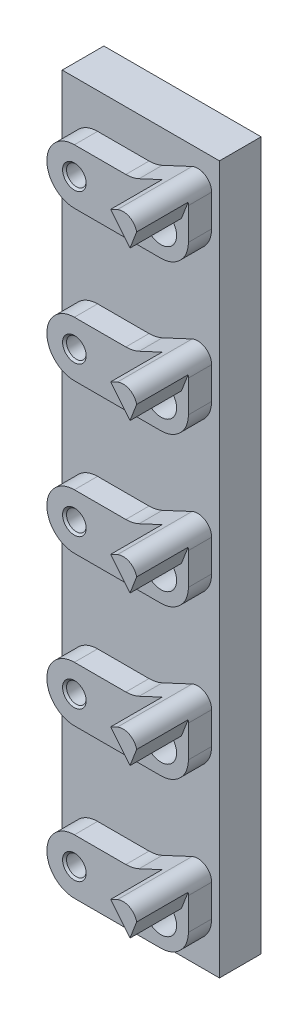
ISO-10303-21;
HEADER;
FILE_DESCRIPTION(('STEP AP214'),'2;1');
FILE_NAME('part.step','',(''),(''),'','','');
FILE_SCHEMA(('AUTOMOTIVE_DESIGN { 1 0 10303 214 1 1 1 1 }'));
ENDSEC;
DATA;
#1=APPLICATION_CONTEXT('core data for automotive mechanical design processes');
#2=APPLICATION_PROTOCOL_DEFINITION('international standard','automotive_design',2000,#1);
#3=PRODUCT_CONTEXT('',#1,'mechanical');
#4=PRODUCT('Part','Part','',(#3));
#5=PRODUCT_RELATED_PRODUCT_CATEGORY('part','',(#4));
#6=PRODUCT_DEFINITION_FORMATION('','',#4);
#7=PRODUCT_DEFINITION_CONTEXT('part definition',#1,'design');
#8=PRODUCT_DEFINITION('design','',#6,#7);
#9=PRODUCT_DEFINITION_SHAPE('','',#8);
#10=(LENGTH_UNIT() NAMED_UNIT(*) SI_UNIT(.MILLI.,.METRE.));
#11=(NAMED_UNIT(*) PLANE_ANGLE_UNIT() SI_UNIT($,.RADIAN.));
#12=(NAMED_UNIT(*) SI_UNIT($,.STERADIAN.) SOLID_ANGLE_UNIT());
#13=UNCERTAINTY_MEASURE_WITH_UNIT(LENGTH_MEASURE(1.E-05),#10,'distance_accuracy_value','');
#14=(GEOMETRIC_REPRESENTATION_CONTEXT(3) GLOBAL_UNCERTAINTY_ASSIGNED_CONTEXT((#13)) GLOBAL_UNIT_ASSIGNED_CONTEXT((#10,
#11,#12)) REPRESENTATION_CONTEXT('',''));
#15=CARTESIAN_POINT('',(0.,0.,0.));
#16=DIRECTION('',(0.,0.,1.));
#17=DIRECTION('',(1.,0.,0.));
#18=AXIS2_PLACEMENT_3D('',#15,#16,#17);
#19=CARTESIAN_POINT('',(4.50000000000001,84.,0.));
#20=DIRECTION('',(0.,0.,-1.));
#21=DIRECTION('',(-1.,0.,0.));
#22=AXIS2_PLACEMENT_3D('',#19,#20,#21);
#23=PLANE('',#22);
#24=CARTESIAN_POINT('',(1.75,61.05,0.));
#25=DIRECTION('',(0.,0.,1.));
#26=DIRECTION('',(-1.,0.,0.));
#27=AXIS2_PLACEMENT_3D('',#24,#25,#26);
#28=CIRCLE('',#27,1.75);
#29=CARTESIAN_POINT('',(3.5,61.05,0.));
#30=VERTEX_POINT('',#29);
#31=CARTESIAN_POINT('',(1.01041804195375,62.6360386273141,0.));
#32=VERTEX_POINT('',#31);
#33=EDGE_CURVE('E1869',#30,#32,#28,.T.);
#34=ORIENTED_EDGE('',*,*,#33,.F.);
#35=DIRECTION('',(0.,1.,0.));
#36=VECTOR('',#35,1.);
#37=CARTESIAN_POINT('',(3.5,57.,0.));
#38=LINE('',#37,#36);
#39=CARTESIAN_POINT('',(3.5,57.,0.));
#40=VERTEX_POINT('',#39);
#41=EDGE_CURVE('E1893',#40,#30,#38,.T.);
#42=ORIENTED_EDGE('',*,*,#41,.F.);
#43=CARTESIAN_POINT('',(0.,57.,0.));
#44=DIRECTION('',(0.,0.,1.));
#45=DIRECTION('',(1.,0.,0.));
#46=AXIS2_PLACEMENT_3D('',#43,#44,#45);
#47=CIRCLE('',#46,3.5);
#48=CARTESIAN_POINT('',(0.,53.5,0.));
#49=VERTEX_POINT('',#48);
#50=EDGE_CURVE('E1890',#49,#40,#47,.T.);
#51=ORIENTED_EDGE('',*,*,#50,.F.);
#52=DIRECTION('',(1.,0.,0.));
#53=VECTOR('',#52,1.);
#54=CARTESIAN_POINT('',(0.,53.5,0.));
#55=LINE('',#54,#53);
#56=CARTESIAN_POINT('',(-11.,53.5,0.));
#57=VERTEX_POINT('',#56);
#58=EDGE_CURVE('E1887',#57,#49,#55,.T.);
#59=ORIENTED_EDGE('',*,*,#58,.F.);
#60=CARTESIAN_POINT('',(-11.,57.,0.));
#61=DIRECTION('',(0.,0.,1.));
#62=DIRECTION('',(1.,0.,0.));
#63=AXIS2_PLACEMENT_3D('',#60,#61,#62);
#64=CIRCLE('',#63,3.5);
#65=CARTESIAN_POINT('',(-11.,60.5,0.));
#66=VERTEX_POINT('',#65);
#67=EDGE_CURVE('E1884',#66,#57,#64,.T.);
#68=ORIENTED_EDGE('',*,*,#67,.F.);
#69=DIRECTION('',(-1.,0.,0.));
#70=VECTOR('',#69,1.);
#71=CARTESIAN_POINT('',(-11.,60.5,0.));
#72=LINE('',#71,#70);
#73=CARTESIAN_POINT('',(-4.45711022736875,60.5,0.));
#74=VERTEX_POINT('',#73);
#75=EDGE_CURVE('E1881',#74,#66,#72,.T.);
#76=ORIENTED_EDGE('',*,*,#75,.F.);
#77=CARTESIAN_POINT('',(-4.45711022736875,64.5,0.));
#78=DIRECTION('',(0.,0.,-1.));
#79=DIRECTION('',(1.,0.,0.));
#80=AXIS2_PLACEMENT_3D('',#77,#78,#79);
#81=CIRCLE('',#80,4.);
#82=CARTESIAN_POINT('',(-2.7666371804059,60.8747688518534,0.));
#83=VERTEX_POINT('',#82);
#84=EDGE_CURVE('E1878',#83,#74,#81,.T.);
#85=ORIENTED_EDGE('',*,*,#84,.F.);
#86=DIRECTION('',(-0.906307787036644,-0.422618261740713,0.));
#87=VECTOR('',#86,1.);
#88=CARTESIAN_POINT('',(-2.7666371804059,60.8747688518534,0.));
#89=LINE('',#88,#87);
#90=EDGE_CURVE('E1875',#32,#83,#89,.T.);
#91=ORIENTED_EDGE('',*,*,#90,.F.);
#92=EDGE_LOOP('',(#34,#42,#51,#59,#68,#76,#85,#91));
#93=FACE_BOUND('',#92,.T.);
#94=CARTESIAN_POINT('',(1.75,23.05,0.));
#95=DIRECTION('',(0.,0.,1.));
#96=DIRECTION('',(-1.,0.,0.));
#97=AXIS2_PLACEMENT_3D('',#94,#95,#96);
#98=CIRCLE('',#97,1.75);
#99=CARTESIAN_POINT('',(3.5,23.05,0.));
#100=VERTEX_POINT('',#99);
#101=CARTESIAN_POINT('',(1.01041804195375,24.6360386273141,0.));
#102=VERTEX_POINT('',#101);
#103=EDGE_CURVE('E1035',#100,#102,#98,.T.);
#104=ORIENTED_EDGE('',*,*,#103,.F.);
#105=DIRECTION('',(0.,1.,0.));
#106=VECTOR('',#105,1.);
#107=CARTESIAN_POINT('',(3.5,19.,0.));
#108=LINE('',#107,#106);
#109=CARTESIAN_POINT('',(3.5,19.,0.));
#110=VERTEX_POINT('',#109);
#111=EDGE_CURVE('E1052',#110,#100,#108,.T.);
#112=ORIENTED_EDGE('',*,*,#111,.F.);
#113=CARTESIAN_POINT('',(0.,19.,0.));
#114=DIRECTION('',(0.,0.,1.));
#115=DIRECTION('',(1.,0.,0.));
#116=AXIS2_PLACEMENT_3D('',#113,#114,#115);
#117=CIRCLE('',#116,3.5);
#118=CARTESIAN_POINT('',(0.,15.5,0.));
#119=VERTEX_POINT('',#118);
#120=EDGE_CURVE('E1097',#119,#110,#117,.T.);
#121=ORIENTED_EDGE('',*,*,#120,.F.);
#122=DIRECTION('',(1.,0.,0.));
#123=VECTOR('',#122,1.);
#124=CARTESIAN_POINT('',(0.,15.5,0.));
#125=LINE('',#124,#123);
#126=CARTESIAN_POINT('',(-11.,15.5,0.));
#127=VERTEX_POINT('',#126);
#128=EDGE_CURVE('E1092',#127,#119,#125,.T.);
#129=ORIENTED_EDGE('',*,*,#128,.F.);
#130=CARTESIAN_POINT('',(-11.,19.,0.));
#131=DIRECTION('',(0.,0.,1.));
#132=DIRECTION('',(1.,0.,0.));
#133=AXIS2_PLACEMENT_3D('',#130,#131,#132);
#134=CIRCLE('',#133,3.5);
#135=CARTESIAN_POINT('',(-11.,22.5,0.));
#136=VERTEX_POINT('',#135);
#137=EDGE_CURVE('E1087',#136,#127,#134,.T.);
#138=ORIENTED_EDGE('',*,*,#137,.F.);
#139=DIRECTION('',(-1.,0.,0.));
#140=VECTOR('',#139,1.);
#141=CARTESIAN_POINT('',(-11.,22.5,0.));
#142=LINE('',#141,#140);
#143=CARTESIAN_POINT('',(-4.45711022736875,22.5,0.));
#144=VERTEX_POINT('',#143);
#145=EDGE_CURVE('E1090',#144,#136,#142,.T.);
#146=ORIENTED_EDGE('',*,*,#145,.F.);
#147=CARTESIAN_POINT('',(-4.45711022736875,26.5,0.));
#148=DIRECTION('',(0.,0.,-1.));
#149=DIRECTION('',(1.,0.,0.));
#150=AXIS2_PLACEMENT_3D('',#147,#148,#149);
#151=CIRCLE('',#150,4.);
#152=CARTESIAN_POINT('',(-2.7666371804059,22.8747688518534,0.));
#153=VERTEX_POINT('',#152);
#154=EDGE_CURVE('E1034',#153,#144,#151,.T.);
#155=ORIENTED_EDGE('',*,*,#154,.F.);
#156=DIRECTION('',(-0.906307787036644,-0.422618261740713,0.));
#157=VECTOR('',#156,1.);
#158=CARTESIAN_POINT('',(-2.7666371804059,22.8747688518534,0.));
#159=LINE('',#158,#157);
#160=EDGE_CURVE('E1027',#102,#153,#159,.T.);
#161=ORIENTED_EDGE('',*,*,#160,.F.);
#162=EDGE_LOOP('',(#104,#112,#121,#129,#138,#146,#155,#161));
#163=FACE_BOUND('',#162,.T.);
#164=DIRECTION('',(0.,-1.,0.));
#165=VECTOR('',#164,1.);
#166=CARTESIAN_POINT('',(4.50000000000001,84.,0.));
#167=LINE('',#166,#165);
#168=CARTESIAN_POINT('',(4.50000000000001,84.,0.));
#169=VERTEX_POINT('',#168);
#170=CARTESIAN_POINT('',(4.5,-6.,0.));
#171=VERTEX_POINT('',#170);
#172=EDGE_CURVE('E751',#169,#171,#167,.T.);
#173=ORIENTED_EDGE('',*,*,#172,.F.);
#174=DIRECTION('',(1.,0.,0.));
#175=VECTOR('',#174,1.);
#176=CARTESIAN_POINT('',(4.50000000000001,84.,0.));
#177=LINE('',#176,#175);
#178=CARTESIAN_POINT('',(-15.5,84.,0.));
#179=VERTEX_POINT('',#178);
#180=EDGE_CURVE('E759',#179,#169,#177,.T.);
#181=ORIENTED_EDGE('',*,*,#180,.F.);
#182=DIRECTION('',(0.,1.,0.));
#183=VECTOR('',#182,1.);
#184=CARTESIAN_POINT('',(-15.5,84.,0.));
#185=LINE('',#184,#183);
#186=CARTESIAN_POINT('',(-15.5,-6.00000000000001,0.));
#187=VERTEX_POINT('',#186);
#188=EDGE_CURVE('E757',#187,#179,#185,.T.);
#189=ORIENTED_EDGE('',*,*,#188,.F.);
#190=DIRECTION('',(-1.,0.,0.));
#191=VECTOR('',#190,1.);
#192=CARTESIAN_POINT('',(4.5,-6.,0.));
#193=LINE('',#192,#191);
#194=EDGE_CURVE('E754',#171,#187,#193,.T.);
#195=ORIENTED_EDGE('',*,*,#194,.F.);
#196=EDGE_LOOP('',(#173,#181,#189,#195));
#197=FACE_BOUND('',#196,.T.);
#198=DIRECTION('',(-0.906307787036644,-0.422618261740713,0.));
#199=VECTOR('',#198,1.);
#200=CARTESIAN_POINT('',(-2.7666371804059,3.87476885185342,0.));
#201=LINE('',#200,#199);
#202=CARTESIAN_POINT('',(1.01041804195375,5.63603862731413,0.));
#203=VERTEX_POINT('',#202);
#204=CARTESIAN_POINT('',(-2.7666371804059,3.87476885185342,0.));
#205=VERTEX_POINT('',#204);
#206=EDGE_CURVE('E819',#203,#205,#201,.T.);
#207=ORIENTED_EDGE('',*,*,#206,.F.);
#208=CARTESIAN_POINT('',(1.75,4.05,0.));
#209=DIRECTION('',(0.,0.,1.));
#210=DIRECTION('',(-1.,0.,0.));
#211=AXIS2_PLACEMENT_3D('',#208,#209,#210);
#212=CIRCLE('',#211,1.75);
#213=CARTESIAN_POINT('',(3.5,4.05,0.));
#214=VERTEX_POINT('',#213);
#215=EDGE_CURVE('E813',#214,#203,#212,.T.);
#216=ORIENTED_EDGE('',*,*,#215,.F.);
#217=DIRECTION('',(0.,1.,0.));
#218=VECTOR('',#217,1.);
#219=CARTESIAN_POINT('',(3.5,0.,0.));
#220=LINE('',#219,#218);
#221=CARTESIAN_POINT('',(3.5,0.,0.));
#222=VERTEX_POINT('',#221);
#223=EDGE_CURVE('E837',#222,#214,#220,.T.);
#224=ORIENTED_EDGE('',*,*,#223,.F.);
#225=CARTESIAN_POINT('',(0.,0.,0.));
#226=DIRECTION('',(0.,0.,1.));
#227=DIRECTION('',(1.,0.,0.));
#228=AXIS2_PLACEMENT_3D('',#225,#226,#227);
#229=CIRCLE('',#228,3.5);
#230=CARTESIAN_POINT('',(0.,-3.5,0.));
#231=VERTEX_POINT('',#230);
#232=EDGE_CURVE('E834',#231,#222,#229,.T.);
#233=ORIENTED_EDGE('',*,*,#232,.F.);
#234=DIRECTION('',(1.,0.,0.));
#235=VECTOR('',#234,1.);
#236=CARTESIAN_POINT('',(0.,-3.5,0.));
#237=LINE('',#236,#235);
#238=CARTESIAN_POINT('',(-11.,-3.5,0.));
#239=VERTEX_POINT('',#238);
#240=EDGE_CURVE('E831',#239,#231,#237,.T.);
#241=ORIENTED_EDGE('',*,*,#240,.F.);
#242=CARTESIAN_POINT('',(-11.,0.,0.));
#243=DIRECTION('',(0.,0.,1.));
#244=DIRECTION('',(1.,0.,0.));
#245=AXIS2_PLACEMENT_3D('',#242,#243,#244);
#246=CIRCLE('',#245,3.5);
#247=CARTESIAN_POINT('',(-11.,3.5,0.));
#248=VERTEX_POINT('',#247);
#249=EDGE_CURVE('E828',#248,#239,#246,.T.);
#250=ORIENTED_EDGE('',*,*,#249,.F.);
#251=DIRECTION('',(-1.,0.,0.));
#252=VECTOR('',#251,1.);
#253=CARTESIAN_POINT('',(-11.,3.5,0.));
#254=LINE('',#253,#252);
#255=CARTESIAN_POINT('',(-4.45711022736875,3.5,0.));
#256=VERTEX_POINT('',#255);
#257=EDGE_CURVE('E825',#256,#248,#254,.T.);
#258=ORIENTED_EDGE('',*,*,#257,.F.);
#259=CARTESIAN_POINT('',(-4.45711022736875,7.5,0.));
#260=DIRECTION('',(0.,0.,-1.));
#261=DIRECTION('',(1.,0.,0.));
#262=AXIS2_PLACEMENT_3D('',#259,#260,#261);
#263=CIRCLE('',#262,4.);
#264=EDGE_CURVE('E822',#205,#256,#263,.T.);
#265=ORIENTED_EDGE('',*,*,#264,.F.);
#266=EDGE_LOOP('',(#207,#216,#224,#233,#241,#250,#258,#265));
#267=FACE_BOUND('',#266,.T.);
#268=CARTESIAN_POINT('',(1.75,42.05,0.));
#269=DIRECTION('',(0.,0.,1.));
#270=DIRECTION('',(-1.,0.,0.));
#271=AXIS2_PLACEMENT_3D('',#268,#269,#270);
#272=CIRCLE('',#271,1.75);
#273=CARTESIAN_POINT('',(3.5,42.05,0.));
#274=VERTEX_POINT('',#273);
#275=CARTESIAN_POINT('',(1.01041804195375,43.6360386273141,0.));
#276=VERTEX_POINT('',#275);
#277=EDGE_CURVE('E1743',#274,#276,#272,.T.);
#278=ORIENTED_EDGE('',*,*,#277,.F.);
#279=DIRECTION('',(0.,1.,0.));
#280=VECTOR('',#279,1.);
#281=CARTESIAN_POINT('',(3.5,38.,0.));
#282=LINE('',#281,#280);
#283=CARTESIAN_POINT('',(3.5,38.,0.));
#284=VERTEX_POINT('',#283);
#285=EDGE_CURVE('E1767',#284,#274,#282,.T.);
#286=ORIENTED_EDGE('',*,*,#285,.F.);
#287=CARTESIAN_POINT('',(0.,38.,0.));
#288=DIRECTION('',(0.,0.,1.));
#289=DIRECTION('',(1.,0.,0.));
#290=AXIS2_PLACEMENT_3D('',#287,#288,#289);
#291=CIRCLE('',#290,3.5);
#292=CARTESIAN_POINT('',(0.,34.5,0.));
#293=VERTEX_POINT('',#292);
#294=EDGE_CURVE('E1764',#293,#284,#291,.T.);
#295=ORIENTED_EDGE('',*,*,#294,.F.);
#296=DIRECTION('',(1.,0.,0.));
#297=VECTOR('',#296,1.);
#298=CARTESIAN_POINT('',(0.,34.5,0.));
#299=LINE('',#298,#297);
#300=CARTESIAN_POINT('',(-11.,34.5,0.));
#301=VERTEX_POINT('',#300);
#302=EDGE_CURVE('E1761',#301,#293,#299,.T.);
#303=ORIENTED_EDGE('',*,*,#302,.F.);
#304=CARTESIAN_POINT('',(-11.,38.,0.));
#305=DIRECTION('',(0.,0.,1.));
#306=DIRECTION('',(1.,0.,0.));
#307=AXIS2_PLACEMENT_3D('',#304,#305,#306);
#308=CIRCLE('',#307,3.5);
#309=CARTESIAN_POINT('',(-11.,41.5,0.));
#310=VERTEX_POINT('',#309);
#311=EDGE_CURVE('E1758',#310,#301,#308,.T.);
#312=ORIENTED_EDGE('',*,*,#311,.F.);
#313=DIRECTION('',(-1.,0.,0.));
#314=VECTOR('',#313,1.);
#315=CARTESIAN_POINT('',(-11.,41.5,0.));
#316=LINE('',#315,#314);
#317=CARTESIAN_POINT('',(-4.45711022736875,41.5,0.));
#318=VERTEX_POINT('',#317);
#319=EDGE_CURVE('E1755',#318,#310,#316,.T.);
#320=ORIENTED_EDGE('',*,*,#319,.F.);
#321=CARTESIAN_POINT('',(-4.45711022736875,45.5,0.));
#322=DIRECTION('',(0.,0.,-1.));
#323=DIRECTION('',(1.,0.,0.));
#324=AXIS2_PLACEMENT_3D('',#321,#322,#323);
#325=CIRCLE('',#324,4.);
#326=CARTESIAN_POINT('',(-2.7666371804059,41.8747688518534,0.));
#327=VERTEX_POINT('',#326);
#328=EDGE_CURVE('E1752',#327,#318,#325,.T.);
#329=ORIENTED_EDGE('',*,*,#328,.F.);
#330=DIRECTION('',(-0.906307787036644,-0.422618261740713,0.));
#331=VECTOR('',#330,1.);
#332=CARTESIAN_POINT('',(-2.7666371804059,41.8747688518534,0.));
#333=LINE('',#332,#331);
#334=EDGE_CURVE('E1749',#276,#327,#333,.T.);
#335=ORIENTED_EDGE('',*,*,#334,.F.);
#336=EDGE_LOOP('',(#278,#286,#295,#303,#312,#320,#329,#335));
#337=FACE_BOUND('',#336,.T.);
#338=CARTESIAN_POINT('',(1.75,80.05,0.));
#339=DIRECTION('',(0.,0.,1.));
#340=DIRECTION('',(-1.,0.,0.));
#341=AXIS2_PLACEMENT_3D('',#338,#339,#340);
#342=CIRCLE('',#341,1.75);
#343=CARTESIAN_POINT('',(3.5,80.05,0.));
#344=VERTEX_POINT('',#343);
#345=CARTESIAN_POINT('',(1.01041804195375,81.6360386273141,0.));
#346=VERTEX_POINT('',#345);
#347=EDGE_CURVE('E422',#344,#346,#342,.T.);
#348=ORIENTED_EDGE('',*,*,#347,.F.);
#349=DIRECTION('',(0.,1.,0.));
#350=VECTOR('',#349,1.);
#351=CARTESIAN_POINT('',(3.5,76.,0.));
#352=LINE('',#351,#350);
#353=CARTESIAN_POINT('',(3.5,76.,0.));
#354=VERTEX_POINT('',#353);
#355=EDGE_CURVE('E444',#354,#344,#352,.T.);
#356=ORIENTED_EDGE('',*,*,#355,.F.);
#357=CARTESIAN_POINT('',(0.,76.,0.));
#358=DIRECTION('',(0.,0.,1.));
#359=DIRECTION('',(1.,0.,0.));
#360=AXIS2_PLACEMENT_3D('',#357,#358,#359);
#361=CIRCLE('',#360,3.5);
#362=CARTESIAN_POINT('',(0.,72.5,0.));
#363=VERTEX_POINT('',#362);
#364=EDGE_CURVE('E441',#363,#354,#361,.T.);
#365=ORIENTED_EDGE('',*,*,#364,.F.);
#366=DIRECTION('',(1.,0.,0.));
#367=VECTOR('',#366,1.);
#368=CARTESIAN_POINT('',(0.,72.5,0.));
#369=LINE('',#368,#367);
#370=CARTESIAN_POINT('',(-11.,72.5,0.));
#371=VERTEX_POINT('',#370);
#372=EDGE_CURVE('E438',#371,#363,#369,.T.);
#373=ORIENTED_EDGE('',*,*,#372,.F.);
#374=CARTESIAN_POINT('',(-11.,76.,0.));
#375=DIRECTION('',(0.,0.,1.));
#376=DIRECTION('',(1.,0.,0.));
#377=AXIS2_PLACEMENT_3D('',#374,#375,#376);
#378=CIRCLE('',#377,3.5);
#379=CARTESIAN_POINT('',(-11.,79.5,0.));
#380=VERTEX_POINT('',#379);
#381=EDGE_CURVE('E435',#380,#371,#378,.T.);
#382=ORIENTED_EDGE('',*,*,#381,.F.);
#383=DIRECTION('',(-1.,0.,0.));
#384=VECTOR('',#383,1.);
#385=CARTESIAN_POINT('',(-11.,79.5,0.));
#386=LINE('',#385,#384);
#387=CARTESIAN_POINT('',(-4.45711022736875,79.5,0.));
#388=VERTEX_POINT('',#387);
#389=EDGE_CURVE('E432',#388,#380,#386,.T.);
#390=ORIENTED_EDGE('',*,*,#389,.F.);
#391=CARTESIAN_POINT('',(-4.45711022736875,83.5,0.));
#392=DIRECTION('',(0.,0.,-1.));
#393=DIRECTION('',(1.,0.,0.));
#394=AXIS2_PLACEMENT_3D('',#391,#392,#393);
#395=CIRCLE('',#394,4.);
#396=CARTESIAN_POINT('',(-2.7666371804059,79.8747688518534,0.));
#397=VERTEX_POINT('',#396);
#398=EDGE_CURVE('E46',#397,#388,#395,.T.);
#399=ORIENTED_EDGE('',*,*,#398,.F.);
#400=DIRECTION('',(-0.906307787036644,-0.422618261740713,0.));
#401=VECTOR('',#400,1.);
#402=CARTESIAN_POINT('',(-2.7666371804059,79.8747688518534,0.));
#403=LINE('',#402,#401);
#404=EDGE_CURVE('E41',#346,#397,#403,.T.);
#405=ORIENTED_EDGE('',*,*,#404,.F.);
#406=EDGE_LOOP('',(#348,#356,#365,#373,#382,#390,#399,#405));
#407=FACE_BOUND('',#406,.T.);
#408=ADVANCED_FACE('F26',(#93,#163,#197,#267,#337,#407),#23,.F.);
#409=CARTESIAN_POINT('',(1.75,4.05,2.95));
#410=DIRECTION('',(0.,0.,-1.));
#411=DIRECTION('',(-1.,0.,0.));
#412=AXIS2_PLACEMENT_3D('',#409,#410,#411);
#413=PLANE('',#412);
#414=CARTESIAN_POINT('',(-11.,0.,2.95));
#415=DIRECTION('',(0.,0.,1.));
#416=DIRECTION('',(1.,0.,0.));
#417=AXIS2_PLACEMENT_3D('',#414,#415,#416);
#418=CIRCLE('',#417,1.5);
#419=CARTESIAN_POINT('',(-9.5,0.,2.95));
#420=VERTEX_POINT('',#419);
#421=EDGE_CURVE('E785',#420,#420,#418,.T.);
#422=ORIENTED_EDGE('',*,*,#421,.F.);
#423=EDGE_LOOP('',(#422));
#424=FACE_BOUND('',#423,.T.);
#425=CARTESIAN_POINT('',(0.,0.,2.95));
#426=DIRECTION('',(0.,0.,1.));
#427=DIRECTION('',(1.,0.,0.));
#428=AXIS2_PLACEMENT_3D('',#425,#426,#427);
#429=CIRCLE('',#428,2.);
#430=CARTESIAN_POINT('',(2.,0.,2.95));
#431=VERTEX_POINT('',#430);
#432=EDGE_CURVE('E573',#431,#431,#429,.T.);
#433=ORIENTED_EDGE('',*,*,#432,.F.);
#434=EDGE_LOOP('',(#433));
#435=FACE_BOUND('',#434,.T.);
#436=DIRECTION('',(0.35836794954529,0.933580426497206,0.));
#437=VECTOR('',#436,1.);
#438=CARTESIAN_POINT('',(2.61919284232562,2.2,2.95));
#439=LINE('',#438,#437);
#440=CARTESIAN_POINT('',(2.61919284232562,2.2,2.95));
#441=VERTEX_POINT('',#440);
#442=CARTESIAN_POINT('',(3.46431281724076,4.40161280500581,2.95));
#443=VERTEX_POINT('',#442);
#444=EDGE_CURVE('E589',#441,#443,#439,.T.);
#445=ORIENTED_EDGE('',*,*,#444,.F.);
#446=DIRECTION('',(0.629320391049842,-0.777145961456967,0.));
#447=VECTOR('',#446,1.);
#448=CARTESIAN_POINT('',(0.158452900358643,5.23876075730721,2.95));
#449=LINE('',#448,#447);
#450=CARTESIAN_POINT('',(0.158452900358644,5.23876075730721,2.95));
#451=VERTEX_POINT('',#450);
#452=EDGE_CURVE('E577',#451,#441,#449,.T.);
#453=ORIENTED_EDGE('',*,*,#452,.F.);
#454=DIRECTION('',(-0.906307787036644,-0.422618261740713,0.));
#455=VECTOR('',#454,1.);
#456=CARTESIAN_POINT('',(-2.7666371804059,3.87476885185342,2.95));
#457=LINE('',#456,#455);
#458=CARTESIAN_POINT('',(-2.7666371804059,3.87476885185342,2.95));
#459=VERTEX_POINT('',#458);
#460=EDGE_CURVE('E847',#451,#459,#457,.T.);
#461=ORIENTED_EDGE('',*,*,#460,.T.);
#462=CARTESIAN_POINT('',(-4.45711022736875,7.5,2.95));
#463=DIRECTION('',(0.,0.,-1.));
#464=DIRECTION('',(1.,0.,0.));
#465=AXIS2_PLACEMENT_3D('',#462,#463,#464);
#466=CIRCLE('',#465,4.);
#467=CARTESIAN_POINT('',(-4.45711022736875,3.5,2.95));
#468=VERTEX_POINT('',#467);
#469=EDGE_CURVE('E849',#459,#468,#466,.T.);
#470=ORIENTED_EDGE('',*,*,#469,.T.);
#471=DIRECTION('',(-1.,0.,0.));
#472=VECTOR('',#471,1.);
#473=CARTESIAN_POINT('',(-11.,3.5,2.95));
#474=LINE('',#473,#472);
#475=CARTESIAN_POINT('',(-11.,3.5,2.95));
#476=VERTEX_POINT('',#475);
#477=EDGE_CURVE('E853',#468,#476,#474,.T.);
#478=ORIENTED_EDGE('',*,*,#477,.T.);
#479=CARTESIAN_POINT('',(-11.,0.,2.95));
#480=DIRECTION('',(0.,0.,1.));
#481=DIRECTION('',(1.,0.,0.));
#482=AXIS2_PLACEMENT_3D('',#479,#480,#481);
#483=CIRCLE('',#482,3.5);
#484=CARTESIAN_POINT('',(-11.,-3.5,2.95));
#485=VERTEX_POINT('',#484);
#486=EDGE_CURVE('E856',#476,#485,#483,.T.);
#487=ORIENTED_EDGE('',*,*,#486,.T.);
#488=DIRECTION('',(1.,0.,0.));
#489=VECTOR('',#488,1.);
#490=CARTESIAN_POINT('',(0.,-3.5,2.95));
#491=LINE('',#490,#489);
#492=CARTESIAN_POINT('',(0.,-3.5,2.95));
#493=VERTEX_POINT('',#492);
#494=EDGE_CURVE('E860',#485,#493,#491,.T.);
#495=ORIENTED_EDGE('',*,*,#494,.T.);
#496=CARTESIAN_POINT('',(0.,0.,2.95));
#497=DIRECTION('',(0.,0.,1.));
#498=DIRECTION('',(1.,0.,0.));
#499=AXIS2_PLACEMENT_3D('',#496,#497,#498);
#500=CIRCLE('',#499,3.5);
#501=CARTESIAN_POINT('',(3.5,0.,2.95));
#502=VERTEX_POINT('',#501);
#503=EDGE_CURVE('E862',#493,#502,#500,.T.);
#504=ORIENTED_EDGE('',*,*,#503,.T.);
#505=DIRECTION('',(0.,1.,0.));
#506=VECTOR('',#505,1.);
#507=CARTESIAN_POINT('',(3.5,0.,2.95));
#508=LINE('',#507,#506);
#509=CARTESIAN_POINT('',(3.5,4.05,2.95));
#510=VERTEX_POINT('',#509);
#511=EDGE_CURVE('E864',#502,#510,#508,.T.);
#512=ORIENTED_EDGE('',*,*,#511,.T.);
#513=CARTESIAN_POINT('',(1.75,4.05,2.95));
#514=DIRECTION('',(0.,0.,1.));
#515=DIRECTION('',(-1.,0.,0.));
#516=AXIS2_PLACEMENT_3D('',#513,#514,#515);
#517=CIRCLE('',#516,1.75);
#518=EDGE_CURVE('E798',#510,#443,#517,.T.);
#519=ORIENTED_EDGE('',*,*,#518,.T.);
#520=EDGE_LOOP('',(#445,#453,#461,#470,#478,#487,#495,#504,#512,#519));
#521=FACE_BOUND('',#520,.T.);
#522=ADVANCED_FACE('F537',(#424,#435,#521),#413,.F.);
#523=CARTESIAN_POINT('',(1.75,4.05,2.95));
#524=DIRECTION('',(0.,0.,-1.));
#525=DIRECTION('',(-1.,0.,0.));
#526=AXIS2_PLACEMENT_3D('',#523,#524,#525);
#527=CYLINDRICAL_SURFACE('',#526,1.75);
#528=ORIENTED_EDGE('',*,*,#215,.T.);
#529=DIRECTION('',(0.,0.,-1.));
#530=VECTOR('',#529,1.);
#531=CARTESIAN_POINT('',(1.01041804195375,5.63603862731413,2.95));
#532=LINE('',#531,#530);
#533=CARTESIAN_POINT('',(1.01041804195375,5.63603862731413,9.5));
#534=VERTEX_POINT('',#533);
#535=EDGE_CURVE('E606',#534,#203,#532,.T.);
#536=ORIENTED_EDGE('',*,*,#535,.F.);
#537=CARTESIAN_POINT('',(1.75,4.05,9.5));
#538=DIRECTION('',(0.,0.,1.));
#539=DIRECTION('',(1.,0.,0.));
#540=AXIS2_PLACEMENT_3D('',#537,#538,#539);
#541=CIRCLE('',#540,1.75);
#542=CARTESIAN_POINT('',(3.46431281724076,4.40161280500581,9.5));
#543=VERTEX_POINT('',#542);
#544=EDGE_CURVE('E586',#543,#534,#541,.T.);
#545=ORIENTED_EDGE('',*,*,#544,.F.);
#546=DIRECTION('',(0.,0.,-1.));
#547=VECTOR('',#546,1.);
#548=CARTESIAN_POINT('',(3.46431281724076,4.40161280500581,9.5));
#549=LINE('',#548,#547);
#550=EDGE_CURVE('E595',#543,#443,#549,.T.);
#551=ORIENTED_EDGE('',*,*,#550,.T.);
#552=ORIENTED_EDGE('',*,*,#518,.F.);
#553=DIRECTION('',(0.,0.,-1.));
#554=VECTOR('',#553,1.);
#555=CARTESIAN_POINT('',(3.5,4.05,2.95));
#556=LINE('',#555,#554);
#557=EDGE_CURVE('E866',#510,#214,#556,.T.);
#558=ORIENTED_EDGE('',*,*,#557,.T.);
#559=EDGE_LOOP('',(#528,#536,#545,#551,#552,#558));
#560=FACE_BOUND('',#559,.T.);
#561=ADVANCED_FACE('F28',(#560),#527,.T.);
#562=CARTESIAN_POINT('',(-2.7666371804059,3.87476885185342,2.95));
#563=DIRECTION('',(0.422618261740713,-0.906307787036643,0.));
#564=DIRECTION('',(0.906307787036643,0.422618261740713,0.));
#565=AXIS2_PLACEMENT_3D('',#562,#563,#564);
#566=PLANE('',#565);
#567=ORIENTED_EDGE('',*,*,#206,.T.);
#568=DIRECTION('',(0.,0.,-1.));
#569=VECTOR('',#568,1.);
#570=CARTESIAN_POINT('',(-2.7666371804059,3.87476885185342,2.95));
#571=LINE('',#570,#569);
#572=EDGE_CURVE('E883',#459,#205,#571,.T.);
#573=ORIENTED_EDGE('',*,*,#572,.F.);
#574=ORIENTED_EDGE('',*,*,#460,.F.);
#575=DIRECTION('',(0.,0.,-1.));
#576=VECTOR('',#575,1.);
#577=CARTESIAN_POINT('',(0.158452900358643,5.23876075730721,9.5));
#578=LINE('',#577,#576);
#579=CARTESIAN_POINT('',(0.158452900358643,5.23876075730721,9.5));
#580=VERTEX_POINT('',#579);
#581=EDGE_CURVE('E809',#580,#451,#578,.T.);
#582=ORIENTED_EDGE('',*,*,#581,.F.);
#583=DIRECTION('',(-0.906307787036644,-0.422618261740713,0.));
#584=VECTOR('',#583,1.);
#585=CARTESIAN_POINT('',(1.01041804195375,5.63603862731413,9.5));
#586=LINE('',#585,#584);
#587=EDGE_CURVE('E890',#534,#580,#586,.T.);
#588=ORIENTED_EDGE('',*,*,#587,.F.);
#589=ORIENTED_EDGE('',*,*,#535,.T.);
#590=EDGE_LOOP('',(#567,#573,#574,#582,#588,#589));
#591=FACE_BOUND('',#590,.T.);
#592=ADVANCED_FACE('F889',(#591),#566,.F.);
#593=CARTESIAN_POINT('',(-4.45711022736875,7.5,2.95));
#594=DIRECTION('',(0.,0.,-1.));
#595=DIRECTION('',(-1.,0.,0.));
#596=AXIS2_PLACEMENT_3D('',#593,#594,#595);
#597=CYLINDRICAL_SURFACE('',#596,4.);
#598=ORIENTED_EDGE('',*,*,#264,.T.);
#599=DIRECTION('',(0.,0.,-1.));
#600=VECTOR('',#599,1.);
#601=CARTESIAN_POINT('',(-4.45711022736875,3.5,2.95));
#602=LINE('',#601,#600);
#603=EDGE_CURVE('E881',#468,#256,#602,.T.);
#604=ORIENTED_EDGE('',*,*,#603,.F.);
#605=ORIENTED_EDGE('',*,*,#469,.F.);
#606=ORIENTED_EDGE('',*,*,#572,.T.);
#607=EDGE_LOOP('',(#598,#604,#605,#606));
#608=FACE_BOUND('',#607,.T.);
#609=ADVANCED_FACE('F916',(#608),#597,.F.);
#610=CARTESIAN_POINT('',(-11.,3.5,2.95));
#611=DIRECTION('',(0.,-1.,0.));
#612=DIRECTION('',(0.,0.,-1.));
#613=AXIS2_PLACEMENT_3D('',#610,#611,#612);
#614=PLANE('',#613);
#615=ORIENTED_EDGE('',*,*,#257,.T.);
#616=DIRECTION('',(0.,0.,-1.));
#617=VECTOR('',#616,1.);
#618=CARTESIAN_POINT('',(-11.,3.5,2.95));
#619=LINE('',#618,#617);
#620=EDGE_CURVE('E878',#476,#248,#619,.T.);
#621=ORIENTED_EDGE('',*,*,#620,.F.);
#622=ORIENTED_EDGE('',*,*,#477,.F.);
#623=ORIENTED_EDGE('',*,*,#603,.T.);
#624=EDGE_LOOP('',(#615,#621,#622,#623));
#625=FACE_BOUND('',#624,.T.);
#626=ADVANCED_FACE('F914',(#625),#614,.F.);
#627=CARTESIAN_POINT('',(-11.,0.,2.95));
#628=DIRECTION('',(0.,0.,-1.));
#629=DIRECTION('',(-1.,0.,0.));
#630=AXIS2_PLACEMENT_3D('',#627,#628,#629);
#631=CYLINDRICAL_SURFACE('',#630,3.5);
#632=ORIENTED_EDGE('',*,*,#249,.T.);
#633=DIRECTION('',(0.,0.,-1.));
#634=VECTOR('',#633,1.);
#635=CARTESIAN_POINT('',(-11.,-3.5,2.95));
#636=LINE('',#635,#634);
#637=EDGE_CURVE('E875',#485,#239,#636,.T.);
#638=ORIENTED_EDGE('',*,*,#637,.F.);
#639=ORIENTED_EDGE('',*,*,#486,.F.);
#640=ORIENTED_EDGE('',*,*,#620,.T.);
#641=EDGE_LOOP('',(#632,#638,#639,#640));
#642=FACE_BOUND('',#641,.T.);
#643=ADVANCED_FACE('F911',(#642),#631,.T.);
#644=CARTESIAN_POINT('',(0.,-3.5,2.95));
#645=DIRECTION('',(0.,1.,0.));
#646=DIRECTION('',(-1.,0.,0.));
#647=AXIS2_PLACEMENT_3D('',#644,#645,#646);
#648=PLANE('',#647);
#649=ORIENTED_EDGE('',*,*,#240,.T.);
#650=DIRECTION('',(0.,0.,-1.));
#651=VECTOR('',#650,1.);
#652=CARTESIAN_POINT('',(0.,-3.5,2.95));
#653=LINE('',#652,#651);
#654=EDGE_CURVE('E872',#493,#231,#653,.T.);
#655=ORIENTED_EDGE('',*,*,#654,.F.);
#656=ORIENTED_EDGE('',*,*,#494,.F.);
#657=ORIENTED_EDGE('',*,*,#637,.T.);
#658=EDGE_LOOP('',(#649,#655,#656,#657));
#659=FACE_BOUND('',#658,.T.);
#660=ADVANCED_FACE('F906',(#659),#648,.F.);
#661=CARTESIAN_POINT('',(0.,0.,2.95));
#662=DIRECTION('',(0.,0.,-1.));
#663=DIRECTION('',(-1.,0.,0.));
#664=AXIS2_PLACEMENT_3D('',#661,#662,#663);
#665=CYLINDRICAL_SURFACE('',#664,3.5);
#666=ORIENTED_EDGE('',*,*,#232,.T.);
#667=DIRECTION('',(0.,0.,-1.));
#668=VECTOR('',#667,1.);
#669=CARTESIAN_POINT('',(3.5,0.,2.95));
#670=LINE('',#669,#668);
#671=EDGE_CURVE('E869',#502,#222,#670,.T.);
#672=ORIENTED_EDGE('',*,*,#671,.F.);
#673=ORIENTED_EDGE('',*,*,#503,.F.);
#674=ORIENTED_EDGE('',*,*,#654,.T.);
#675=EDGE_LOOP('',(#666,#672,#673,#674));
#676=FACE_BOUND('',#675,.T.);
#677=ADVANCED_FACE('F903',(#676),#665,.T.);
#678=CARTESIAN_POINT('',(3.5,0.,2.95));
#679=DIRECTION('',(-1.,0.,0.));
#680=DIRECTION('',(0.,-1.,0.));
#681=AXIS2_PLACEMENT_3D('',#678,#679,#680);
#682=PLANE('',#681);
#683=ORIENTED_EDGE('',*,*,#223,.T.);
#684=ORIENTED_EDGE('',*,*,#557,.F.);
#685=ORIENTED_EDGE('',*,*,#511,.F.);
#686=ORIENTED_EDGE('',*,*,#671,.T.);
#687=EDGE_LOOP('',(#683,#684,#685,#686));
#688=FACE_BOUND('',#687,.T.);
#689=ADVANCED_FACE('F898',(#688),#682,.F.);
#690=CARTESIAN_POINT('',(0.158452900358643,5.23876075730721,9.5));
#691=DIRECTION('',(0.777145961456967,0.629320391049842,0.));
#692=DIRECTION('',(-0.629320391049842,0.777145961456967,0.));
#693=AXIS2_PLACEMENT_3D('',#690,#691,#692);
#694=PLANE('',#693);
#695=ORIENTED_EDGE('',*,*,#452,.T.);
#696=DIRECTION('',(0.,0.,-1.));
#697=VECTOR('',#696,1.);
#698=CARTESIAN_POINT('',(2.61919284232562,2.2,9.5));
#699=LINE('',#698,#697);
#700=CARTESIAN_POINT('',(2.61919284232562,2.2,9.5));
#701=VERTEX_POINT('',#700);
#702=EDGE_CURVE('E598',#701,#441,#699,.T.);
#703=ORIENTED_EDGE('',*,*,#702,.F.);
#704=DIRECTION('',(0.629320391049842,-0.777145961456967,0.));
#705=VECTOR('',#704,1.);
#706=CARTESIAN_POINT('',(0.158452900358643,5.23876075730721,9.5));
#707=LINE('',#706,#705);
#708=EDGE_CURVE('E1969',#580,#701,#707,.T.);
#709=ORIENTED_EDGE('',*,*,#708,.F.);
#710=ORIENTED_EDGE('',*,*,#581,.T.);
#711=EDGE_LOOP('',(#695,#703,#709,#710));
#712=FACE_BOUND('',#711,.T.);
#713=ADVANCED_FACE('F805',(#712),#694,.F.);
#714=CARTESIAN_POINT('',(2.61919284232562,2.2,9.5));
#715=DIRECTION('',(-0.933580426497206,0.35836794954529,0.));
#716=DIRECTION('',(-0.35836794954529,-0.933580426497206,0.));
#717=AXIS2_PLACEMENT_3D('',#714,#715,#716);
#718=PLANE('',#717);
#719=ORIENTED_EDGE('',*,*,#444,.T.);
#720=ORIENTED_EDGE('',*,*,#550,.F.);
#721=DIRECTION('',(0.35836794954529,0.933580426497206,0.));
#722=VECTOR('',#721,1.);
#723=CARTESIAN_POINT('',(2.61919284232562,2.2,9.5));
#724=LINE('',#723,#722);
#725=EDGE_CURVE('E599',#701,#543,#724,.T.);
#726=ORIENTED_EDGE('',*,*,#725,.F.);
#727=ORIENTED_EDGE('',*,*,#702,.T.);
#728=EDGE_LOOP('',(#719,#720,#726,#727));
#729=FACE_BOUND('',#728,.T.);
#730=ADVANCED_FACE('F811',(#729),#718,.F.);
#731=CARTESIAN_POINT('',(1.75,4.05,9.5));
#732=DIRECTION('',(0.,0.,1.));
#733=DIRECTION('',(1.,0.,0.));
#734=AXIS2_PLACEMENT_3D('',#731,#732,#733);
#735=PLANE('',#734);
#736=ORIENTED_EDGE('',*,*,#544,.T.);
#737=ORIENTED_EDGE('',*,*,#587,.T.);
#738=ORIENTED_EDGE('',*,*,#708,.T.);
#739=ORIENTED_EDGE('',*,*,#725,.T.);
#740=EDGE_LOOP('',(#736,#737,#738,#739));
#741=FACE_BOUND('',#740,.T.);
#742=ADVANCED_FACE('F936',(#741),#735,.T.);
#743=CARTESIAN_POINT('',(0.,0.,-3.6));
#744=DIRECTION('',(0.,0.,1.));
#745=DIRECTION('',(1.,0.,0.));
#746=AXIS2_PLACEMENT_3D('',#743,#744,#745);
#747=CYLINDRICAL_SURFACE('',#746,2.);
#748=CARTESIAN_POINT('',(0.,0.,0.));
#749=DIRECTION('',(0.,0.,-1.));
#750=DIRECTION('',(-1.,0.,0.));
#751=AXIS2_PLACEMENT_3D('',#748,#749,#750);
#752=CIRCLE('',#751,2.);
#753=CARTESIAN_POINT('',(-2.,0.,0.));
#754=VERTEX_POINT('',#753);
#755=EDGE_CURVE('E782',#754,#754,#752,.F.);
#756=ORIENTED_EDGE('',*,*,#755,.F.);
#757=EDGE_LOOP('',(#756));
#758=FACE_BOUND('',#757,.T.);
#759=ORIENTED_EDGE('',*,*,#432,.T.);
#760=EDGE_LOOP('',(#759));
#761=FACE_BOUND('',#760,.T.);
#762=ADVANCED_FACE('F939',(#758,#761),#747,.F.);
#763=CARTESIAN_POINT('',(-11.,0.,0.249999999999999));
#764=DIRECTION('',(0.,0.,-1.));
#765=DIRECTION('',(-1.,0.,0.));
#766=AXIS2_PLACEMENT_3D('',#763,#764,#765);
#767=CONICAL_SURFACE('',#766,1.25,0.785398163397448);
#768=CARTESIAN_POINT('',(-11.,0.,0.));
#769=DIRECTION('',(0.,0.,1.));
#770=DIRECTION('',(1.,0.,0.));
#771=AXIS2_PLACEMENT_3D('',#768,#769,#770);
#772=CIRCLE('',#771,1.5);
#773=CARTESIAN_POINT('',(-9.5,0.,0.));
#774=VERTEX_POINT('',#773);
#775=EDGE_CURVE('E571',#774,#774,#772,.T.);
#776=ORIENTED_EDGE('',*,*,#775,.F.);
#777=EDGE_LOOP('',(#776));
#778=FACE_BOUND('',#777,.T.);
#779=CARTESIAN_POINT('',(-11.,0.,0.249999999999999));
#780=DIRECTION('',(0.,0.,1.));
#781=DIRECTION('',(1.,0.,0.));
#782=AXIS2_PLACEMENT_3D('',#779,#780,#781);
#783=CIRCLE('',#782,1.25);
#784=CARTESIAN_POINT('',(-9.75,0.,0.249999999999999));
#785=VERTEX_POINT('',#784);
#786=EDGE_CURVE('E574',#785,#785,#783,.T.);
#787=ORIENTED_EDGE('',*,*,#786,.T.);
#788=EDGE_LOOP('',(#787));
#789=FACE_BOUND('',#788,.T.);
#790=ADVANCED_FACE('F943',(#778,#789),#767,.F.);
#791=CARTESIAN_POINT('',(-11.,0.,2.95));
#792=DIRECTION('',(0.,0.,1.));
#793=DIRECTION('',(1.,0.,0.));
#794=AXIS2_PLACEMENT_3D('',#791,#792,#793);
#795=CYLINDRICAL_SURFACE('',#794,1.24999999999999);
#796=ORIENTED_EDGE('',*,*,#786,.F.);
#797=EDGE_LOOP('',(#796));
#798=FACE_BOUND('',#797,.T.);
#799=CARTESIAN_POINT('',(-11.,0.,2.7));
#800=DIRECTION('',(0.,0.,1.));
#801=DIRECTION('',(1.,0.,0.));
#802=AXIS2_PLACEMENT_3D('',#799,#800,#801);
#803=CIRCLE('',#802,1.24999999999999);
#804=CARTESIAN_POINT('',(-9.75000000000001,0.,2.7));
#805=VERTEX_POINT('',#804);
#806=EDGE_CURVE('E580',#805,#805,#803,.T.);
#807=ORIENTED_EDGE('',*,*,#806,.T.);
#808=EDGE_LOOP('',(#807));
#809=FACE_BOUND('',#808,.T.);
#810=ADVANCED_FACE('F566',(#798,#809),#795,.F.);
#811=CARTESIAN_POINT('',(-11.,0.,2.95));
#812=DIRECTION('',(0.,0.,1.));
#813=DIRECTION('',(1.,0.,0.));
#814=AXIS2_PLACEMENT_3D('',#811,#812,#813);
#815=CONICAL_SURFACE('',#814,1.5,0.785398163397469);
#816=ORIENTED_EDGE('',*,*,#806,.F.);
#817=EDGE_LOOP('',(#816));
#818=FACE_BOUND('',#817,.T.);
#819=ORIENTED_EDGE('',*,*,#421,.T.);
#820=EDGE_LOOP('',(#819));
#821=FACE_BOUND('',#820,.T.);
#822=ADVANCED_FACE('F557',(#818,#821),#815,.F.);
#823=ORIENTED_EDGE('',*,*,#775,.T.);
#824=EDGE_LOOP('',(#823));
#825=FACE_BOUND('',#824,.T.);
#826=ADVANCED_FACE('F541',(#825),#23,.F.);
#827=ORIENTED_EDGE('',*,*,#755,.T.);
#828=EDGE_LOOP('',(#827));
#829=FACE_BOUND('',#828,.T.);
#830=ADVANCED_FACE('F556',(#829),#23,.F.);
#831=CARTESIAN_POINT('',(4.50000000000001,84.,-5.3));
#832=DIRECTION('',(-1.,0.,0.));
#833=DIRECTION('',(0.,-1.,0.));
#834=AXIS2_PLACEMENT_3D('',#831,#832,#833);
#835=PLANE('',#834);
#836=ORIENTED_EDGE('',*,*,#172,.T.);
#837=DIRECTION('',(0.,0.,1.));
#838=VECTOR('',#837,1.);
#839=CARTESIAN_POINT('',(4.5,-6.,-5.3));
#840=LINE('',#839,#838);
#841=CARTESIAN_POINT('',(4.5,-6.,-5.3));
#842=VERTEX_POINT('',#841);
#843=EDGE_CURVE('E779',#842,#171,#840,.T.);
#844=ORIENTED_EDGE('',*,*,#843,.F.);
#845=DIRECTION('',(0.,-1.,0.));
#846=VECTOR('',#845,1.);
#847=CARTESIAN_POINT('',(4.50000000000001,84.,-5.3));
#848=LINE('',#847,#846);
#849=CARTESIAN_POINT('',(4.50000000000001,84.,-5.3));
#850=VERTEX_POINT('',#849);
#851=EDGE_CURVE('E761',#850,#842,#848,.T.);
#852=ORIENTED_EDGE('',*,*,#851,.F.);
#853=DIRECTION('',(0.,0.,1.));
#854=VECTOR('',#853,1.);
#855=CARTESIAN_POINT('',(4.50000000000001,84.,-5.3));
#856=LINE('',#855,#854);
#857=EDGE_CURVE('E770',#850,#169,#856,.T.);
#858=ORIENTED_EDGE('',*,*,#857,.T.);
#859=EDGE_LOOP('',(#836,#844,#852,#858));
#860=FACE_BOUND('',#859,.T.);
#861=ADVANCED_FACE('F563',(#860),#835,.F.);
#862=CARTESIAN_POINT('',(4.5,-6.,-5.3));
#863=DIRECTION('',(0.,1.,0.));
#864=DIRECTION('',(-1.,0.,0.));
#865=AXIS2_PLACEMENT_3D('',#862,#863,#864);
#866=PLANE('',#865);
#867=ORIENTED_EDGE('',*,*,#194,.T.);
#868=DIRECTION('',(0.,0.,1.));
#869=VECTOR('',#868,1.);
#870=CARTESIAN_POINT('',(-15.5,-6.00000000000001,-5.3));
#871=LINE('',#870,#869);
#872=CARTESIAN_POINT('',(-15.5,-6.00000000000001,-5.3));
#873=VERTEX_POINT('',#872);
#874=EDGE_CURVE('E776',#873,#187,#871,.T.);
#875=ORIENTED_EDGE('',*,*,#874,.F.);
#876=DIRECTION('',(-1.,0.,0.));
#877=VECTOR('',#876,1.);
#878=CARTESIAN_POINT('',(4.5,-6.,-5.3));
#879=LINE('',#878,#877);
#880=EDGE_CURVE('E764',#842,#873,#879,.T.);
#881=ORIENTED_EDGE('',*,*,#880,.F.);
#882=ORIENTED_EDGE('',*,*,#843,.T.);
#883=EDGE_LOOP('',(#867,#875,#881,#882));
#884=FACE_BOUND('',#883,.T.);
#885=ADVANCED_FACE('F952',(#884),#866,.F.);
#886=CARTESIAN_POINT('',(-15.5,84.,-5.3));
#887=DIRECTION('',(1.,0.,0.));
#888=DIRECTION('',(0.,1.,0.));
#889=AXIS2_PLACEMENT_3D('',#886,#887,#888);
#890=PLANE('',#889);
#891=ORIENTED_EDGE('',*,*,#188,.T.);
#892=DIRECTION('',(0.,0.,1.));
#893=VECTOR('',#892,1.);
#894=CARTESIAN_POINT('',(-15.5,84.,-5.3));
#895=LINE('',#894,#893);
#896=CARTESIAN_POINT('',(-15.5,84.,-5.3));
#897=VERTEX_POINT('',#896);
#898=EDGE_CURVE('E773',#897,#179,#895,.T.);
#899=ORIENTED_EDGE('',*,*,#898,.F.);
#900=DIRECTION('',(0.,1.,0.));
#901=VECTOR('',#900,1.);
#902=CARTESIAN_POINT('',(-15.5,84.,-5.3));
#903=LINE('',#902,#901);
#904=EDGE_CURVE('E766',#873,#897,#903,.T.);
#905=ORIENTED_EDGE('',*,*,#904,.F.);
#906=ORIENTED_EDGE('',*,*,#874,.T.);
#907=EDGE_LOOP('',(#891,#899,#905,#906));
#908=FACE_BOUND('',#907,.T.);
#909=ADVANCED_FACE('F956',(#908),#890,.F.);
#910=CARTESIAN_POINT('',(4.50000000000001,84.,-5.3));
#911=DIRECTION('',(0.,-1.,0.));
#912=DIRECTION('',(0.,0.,-1.));
#913=AXIS2_PLACEMENT_3D('',#910,#911,#912);
#914=PLANE('',#913);
#915=ORIENTED_EDGE('',*,*,#180,.T.);
#916=ORIENTED_EDGE('',*,*,#857,.F.);
#917=DIRECTION('',(1.,0.,0.));
#918=VECTOR('',#917,1.);
#919=CARTESIAN_POINT('',(4.50000000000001,84.,-5.3));
#920=LINE('',#919,#918);
#921=EDGE_CURVE('E768',#897,#850,#920,.T.);
#922=ORIENTED_EDGE('',*,*,#921,.F.);
#923=ORIENTED_EDGE('',*,*,#898,.T.);
#924=EDGE_LOOP('',(#915,#916,#922,#923));
#925=FACE_BOUND('',#924,.T.);
#926=ADVANCED_FACE('F960',(#925),#914,.F.);
#927=CARTESIAN_POINT('',(4.50000000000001,84.,-5.3));
#928=DIRECTION('',(0.,0.,-1.));
#929=DIRECTION('',(-1.,0.,0.));
#930=AXIS2_PLACEMENT_3D('',#927,#928,#929);
#931=PLANE('',#930);
#932=ORIENTED_EDGE('',*,*,#851,.T.);
#933=ORIENTED_EDGE('',*,*,#880,.T.);
#934=ORIENTED_EDGE('',*,*,#904,.T.);
#935=ORIENTED_EDGE('',*,*,#921,.T.);
#936=EDGE_LOOP('',(#932,#933,#934,#935));
#937=FACE_BOUND('',#936,.T.);
#938=ADVANCED_FACE('F963',(#937),#931,.T.);
#939=CARTESIAN_POINT('',(1.75,23.05,2.95));
#940=DIRECTION('',(0.,0.,-1.));
#941=DIRECTION('',(-1.,0.,0.));
#942=AXIS2_PLACEMENT_3D('',#939,#940,#941);
#943=PLANE('',#942);
#944=CARTESIAN_POINT('',(-11.,19.,2.95));
#945=DIRECTION('',(0.,0.,1.));
#946=DIRECTION('',(1.,0.,0.));
#947=AXIS2_PLACEMENT_3D('',#944,#945,#946);
#948=CIRCLE('',#947,1.5);
#949=CARTESIAN_POINT('',(-9.5,19.,2.95));
#950=VERTEX_POINT('',#949);
#951=EDGE_CURVE('E719',#950,#950,#948,.T.);
#952=ORIENTED_EDGE('',*,*,#951,.F.);
#953=EDGE_LOOP('',(#952));
#954=FACE_BOUND('',#953,.T.);
#955=CARTESIAN_POINT('',(0.,19.,2.95));
#956=DIRECTION('',(0.,0.,1.));
#957=DIRECTION('',(1.,0.,0.));
#958=AXIS2_PLACEMENT_3D('',#955,#956,#957);
#959=CIRCLE('',#958,2.);
#960=CARTESIAN_POINT('',(2.,19.,2.95));
#961=VERTEX_POINT('',#960);
#962=EDGE_CURVE('E729',#961,#961,#959,.T.);
#963=ORIENTED_EDGE('',*,*,#962,.F.);
#964=EDGE_LOOP('',(#963));
#965=FACE_BOUND('',#964,.T.);
#966=DIRECTION('',(0.35836794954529,0.933580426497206,0.));
#967=VECTOR('',#966,1.);
#968=CARTESIAN_POINT('',(2.61919284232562,21.2,2.95));
#969=LINE('',#968,#967);
#970=CARTESIAN_POINT('',(2.61919284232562,21.2,2.95));
#971=VERTEX_POINT('',#970);
#972=CARTESIAN_POINT('',(3.46431281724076,23.4016128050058,2.95));
#973=VERTEX_POINT('',#972);
#974=EDGE_CURVE('E738',#971,#973,#969,.T.);
#975=ORIENTED_EDGE('',*,*,#974,.F.);
#976=DIRECTION('',(0.629320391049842,-0.777145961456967,0.));
#977=VECTOR('',#976,1.);
#978=CARTESIAN_POINT('',(0.158452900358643,24.2387607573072,2.95));
#979=LINE('',#978,#977);
#980=CARTESIAN_POINT('',(0.158452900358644,24.2387607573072,2.95));
#981=VERTEX_POINT('',#980);
#982=EDGE_CURVE('E732',#981,#971,#979,.T.);
#983=ORIENTED_EDGE('',*,*,#982,.F.);
#984=DIRECTION('',(-0.906307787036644,-0.422618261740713,0.));
#985=VECTOR('',#984,1.);
#986=CARTESIAN_POINT('',(-2.7666371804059,22.8747688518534,2.95));
#987=LINE('',#986,#985);
#988=CARTESIAN_POINT('',(-2.7666371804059,22.8747688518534,2.95));
#989=VERTEX_POINT('',#988);
#990=EDGE_CURVE('E1051',#981,#989,#987,.T.);
#991=ORIENTED_EDGE('',*,*,#990,.T.);
#992=CARTESIAN_POINT('',(-4.45711022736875,26.5,2.95));
#993=DIRECTION('',(0.,0.,-1.));
#994=DIRECTION('',(1.,0.,0.));
#995=AXIS2_PLACEMENT_3D('',#992,#993,#994);
#996=CIRCLE('',#995,4.);
#997=CARTESIAN_POINT('',(-4.45711022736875,22.5,2.95));
#998=VERTEX_POINT('',#997);
#999=EDGE_CURVE('E1040',#989,#998,#996,.T.);
#1000=ORIENTED_EDGE('',*,*,#999,.T.);
#1001=DIRECTION('',(-1.,0.,0.));
#1002=VECTOR('',#1001,1.);
#1003=CARTESIAN_POINT('',(-11.,22.5,2.95));
#1004=LINE('',#1003,#1002);
#1005=CARTESIAN_POINT('',(-11.,22.5,2.95));
#1006=VERTEX_POINT('',#1005);
#1007=EDGE_CURVE('E1061',#998,#1006,#1004,.T.);
#1008=ORIENTED_EDGE('',*,*,#1007,.T.);
#1009=CARTESIAN_POINT('',(-11.,19.,2.95));
#1010=DIRECTION('',(0.,0.,1.));
#1011=DIRECTION('',(1.,0.,0.));
#1012=AXIS2_PLACEMENT_3D('',#1009,#1010,#1011);
#1013=CIRCLE('',#1012,3.5);
#1014=CARTESIAN_POINT('',(-11.,15.5,2.95));
#1015=VERTEX_POINT('',#1014);
#1016=EDGE_CURVE('E1063',#1006,#1015,#1013,.T.);
#1017=ORIENTED_EDGE('',*,*,#1016,.T.);
#1018=DIRECTION('',(1.,0.,0.));
#1019=VECTOR('',#1018,1.);
#1020=CARTESIAN_POINT('',(0.,15.5,2.95));
#1021=LINE('',#1020,#1019);
#1022=CARTESIAN_POINT('',(0.,15.5,2.95));
#1023=VERTEX_POINT('',#1022);
#1024=EDGE_CURVE('E1065',#1015,#1023,#1021,.T.);
#1025=ORIENTED_EDGE('',*,*,#1024,.T.);
#1026=CARTESIAN_POINT('',(0.,19.,2.95));
#1027=DIRECTION('',(0.,0.,1.));
#1028=DIRECTION('',(1.,0.,0.));
#1029=AXIS2_PLACEMENT_3D('',#1026,#1027,#1028);
#1030=CIRCLE('',#1029,3.5);
#1031=CARTESIAN_POINT('',(3.5,19.,2.95));
#1032=VERTEX_POINT('',#1031);
#1033=EDGE_CURVE('E1067',#1023,#1032,#1030,.T.);
#1034=ORIENTED_EDGE('',*,*,#1033,.T.);
#1035=DIRECTION('',(0.,1.,0.));
#1036=VECTOR('',#1035,1.);
#1037=CARTESIAN_POINT('',(3.5,19.,2.95));
#1038=LINE('',#1037,#1036);
#1039=CARTESIAN_POINT('',(3.5,23.05,2.95));
#1040=VERTEX_POINT('',#1039);
#1041=EDGE_CURVE('E1069',#1032,#1040,#1038,.T.);
#1042=ORIENTED_EDGE('',*,*,#1041,.T.);
#1043=CARTESIAN_POINT('',(1.75,23.05,2.95));
#1044=DIRECTION('',(0.,0.,1.));
#1045=DIRECTION('',(-1.,0.,0.));
#1046=AXIS2_PLACEMENT_3D('',#1043,#1044,#1045);
#1047=CIRCLE('',#1046,1.75);
#1048=EDGE_CURVE('E1048',#1040,#973,#1047,.T.);
#1049=ORIENTED_EDGE('',*,*,#1048,.T.);
#1050=EDGE_LOOP('',(#975,#983,#991,#1000,#1008,#1017,#1025,#1034,#1042,#1049));
#1051=FACE_BOUND('',#1050,.T.);
#1052=ADVANCED_FACE('F966',(#954,#965,#1051),#943,.F.);
#1053=CARTESIAN_POINT('',(1.75,23.05,2.95));
#1054=DIRECTION('',(0.,0.,-1.));
#1055=DIRECTION('',(-1.,0.,0.));
#1056=AXIS2_PLACEMENT_3D('',#1053,#1054,#1055);
#1057=CYLINDRICAL_SURFACE('',#1056,1.75);
#1058=ORIENTED_EDGE('',*,*,#103,.T.);
#1059=DIRECTION('',(0.,0.,-1.));
#1060=VECTOR('',#1059,1.);
#1061=CARTESIAN_POINT('',(1.01041804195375,24.6360386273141,2.95));
#1062=LINE('',#1061,#1060);
#1063=CARTESIAN_POINT('',(1.01041804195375,24.6360386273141,9.5));
#1064=VERTEX_POINT('',#1063);
#1065=EDGE_CURVE('E755',#1064,#102,#1062,.T.);
#1066=ORIENTED_EDGE('',*,*,#1065,.F.);
#1067=CARTESIAN_POINT('',(1.75,23.05,9.5));
#1068=DIRECTION('',(0.,0.,1.));
#1069=DIRECTION('',(1.,0.,0.));
#1070=AXIS2_PLACEMENT_3D('',#1067,#1068,#1069);
#1071=CIRCLE('',#1070,1.75);
#1072=CARTESIAN_POINT('',(3.46431281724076,23.4016128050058,9.5));
#1073=VERTEX_POINT('',#1072);
#1074=EDGE_CURVE('E735',#1073,#1064,#1071,.T.);
#1075=ORIENTED_EDGE('',*,*,#1074,.F.);
#1076=DIRECTION('',(0.,0.,-1.));
#1077=VECTOR('',#1076,1.);
#1078=CARTESIAN_POINT('',(3.46431281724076,23.4016128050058,9.5));
#1079=LINE('',#1078,#1077);
#1080=EDGE_CURVE('E744',#1073,#973,#1079,.T.);
#1081=ORIENTED_EDGE('',*,*,#1080,.T.);
#1082=ORIENTED_EDGE('',*,*,#1048,.F.);
#1083=DIRECTION('',(0.,0.,-1.));
#1084=VECTOR('',#1083,1.);
#1085=CARTESIAN_POINT('',(3.5,23.05,2.95));
#1086=LINE('',#1085,#1084);
#1087=EDGE_CURVE('E1071',#1040,#100,#1086,.T.);
#1088=ORIENTED_EDGE('',*,*,#1087,.T.);
#1089=EDGE_LOOP('',(#1058,#1066,#1075,#1081,#1082,#1088));
#1090=FACE_BOUND('',#1089,.T.);
#1091=ADVANCED_FACE('F971',(#1090),#1057,.T.);
#1092=CARTESIAN_POINT('',(-2.7666371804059,22.8747688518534,2.95));
#1093=DIRECTION('',(0.422618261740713,-0.906307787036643,0.));
#1094=DIRECTION('',(0.906307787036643,0.422618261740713,0.));
#1095=AXIS2_PLACEMENT_3D('',#1092,#1093,#1094);
#1096=PLANE('',#1095);
#1097=ORIENTED_EDGE('',*,*,#160,.T.);
#1098=DIRECTION('',(0.,0.,-1.));
#1099=VECTOR('',#1098,1.);
#1100=CARTESIAN_POINT('',(-2.7666371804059,22.8747688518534,2.95));
#1101=LINE('',#1100,#1099);
#1102=EDGE_CURVE('E1030',#989,#153,#1101,.T.);
#1103=ORIENTED_EDGE('',*,*,#1102,.F.);
#1104=ORIENTED_EDGE('',*,*,#990,.F.);
#1105=DIRECTION('',(0.,0.,-1.));
#1106=VECTOR('',#1105,1.);
#1107=CARTESIAN_POINT('',(0.158452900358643,24.2387607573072,9.5));
#1108=LINE('',#1107,#1106);
#1109=CARTESIAN_POINT('',(0.158452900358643,24.2387607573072,9.5));
#1110=VERTEX_POINT('',#1109);
#1111=EDGE_CURVE('E1115',#1110,#981,#1108,.T.);
#1112=ORIENTED_EDGE('',*,*,#1111,.F.);
#1113=DIRECTION('',(-0.906307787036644,-0.422618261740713,0.));
#1114=VECTOR('',#1113,1.);
#1115=CARTESIAN_POINT('',(1.01041804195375,24.6360386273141,9.5));
#1116=LINE('',#1115,#1114);
#1117=EDGE_CURVE('E1122',#1064,#1110,#1116,.T.);
#1118=ORIENTED_EDGE('',*,*,#1117,.F.);
#1119=ORIENTED_EDGE('',*,*,#1065,.T.);
#1120=EDGE_LOOP('',(#1097,#1103,#1104,#1112,#1118,#1119));
#1121=FACE_BOUND('',#1120,.T.);
#1122=ADVANCED_FACE('F988',(#1121),#1096,.F.);
#1123=CARTESIAN_POINT('',(-4.45711022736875,26.5,2.95));
#1124=DIRECTION('',(0.,0.,-1.));
#1125=DIRECTION('',(-1.,0.,0.));
#1126=AXIS2_PLACEMENT_3D('',#1123,#1124,#1125);
#1127=CYLINDRICAL_SURFACE('',#1126,4.);
#1128=ORIENTED_EDGE('',*,*,#154,.T.);
#1129=DIRECTION('',(0.,0.,-1.));
#1130=VECTOR('',#1129,1.);
#1131=CARTESIAN_POINT('',(-4.45711022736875,22.5,2.95));
#1132=LINE('',#1131,#1130);
#1133=EDGE_CURVE('E1041',#998,#144,#1132,.T.);
#1134=ORIENTED_EDGE('',*,*,#1133,.F.);
#1135=ORIENTED_EDGE('',*,*,#999,.F.);
#1136=ORIENTED_EDGE('',*,*,#1102,.T.);
#1137=EDGE_LOOP('',(#1128,#1134,#1135,#1136));
#1138=FACE_BOUND('',#1137,.T.);
#1139=ADVANCED_FACE('F1015',(#1138),#1127,.F.);
#1140=CARTESIAN_POINT('',(-11.,22.5,2.95));
#1141=DIRECTION('',(0.,-1.,0.));
#1142=DIRECTION('',(0.,0.,-1.));
#1143=AXIS2_PLACEMENT_3D('',#1140,#1141,#1142);
#1144=PLANE('',#1143);
#1145=ORIENTED_EDGE('',*,*,#145,.T.);
#1146=DIRECTION('',(0.,0.,-1.));
#1147=VECTOR('',#1146,1.);
#1148=CARTESIAN_POINT('',(-11.,22.5,2.95));
#1149=LINE('',#1148,#1147);
#1150=EDGE_CURVE('E1044',#1006,#136,#1149,.T.);
#1151=ORIENTED_EDGE('',*,*,#1150,.F.);
#1152=ORIENTED_EDGE('',*,*,#1007,.F.);
#1153=ORIENTED_EDGE('',*,*,#1133,.T.);
#1154=EDGE_LOOP('',(#1145,#1151,#1152,#1153));
#1155=FACE_BOUND('',#1154,.T.);
#1156=ADVANCED_FACE('F1011',(#1155),#1144,.F.);
#1157=CARTESIAN_POINT('',(-11.,19.,2.95));
#1158=DIRECTION('',(0.,0.,-1.));
#1159=DIRECTION('',(-1.,0.,0.));
#1160=AXIS2_PLACEMENT_3D('',#1157,#1158,#1159);
#1161=CYLINDRICAL_SURFACE('',#1160,3.5);
#1162=ORIENTED_EDGE('',*,*,#137,.T.);
#1163=DIRECTION('',(0.,0.,-1.));
#1164=VECTOR('',#1163,1.);
#1165=CARTESIAN_POINT('',(-11.,15.5,2.95));
#1166=LINE('',#1165,#1164);
#1167=EDGE_CURVE('E1080',#1015,#127,#1166,.T.);
#1168=ORIENTED_EDGE('',*,*,#1167,.F.);
#1169=ORIENTED_EDGE('',*,*,#1016,.F.);
#1170=ORIENTED_EDGE('',*,*,#1150,.T.);
#1171=EDGE_LOOP('',(#1162,#1168,#1169,#1170));
#1172=FACE_BOUND('',#1171,.T.);
#1173=ADVANCED_FACE('F1007',(#1172),#1161,.T.);
#1174=CARTESIAN_POINT('',(0.,15.5,2.95));
#1175=DIRECTION('',(0.,1.,0.));
#1176=DIRECTION('',(-1.,0.,0.));
#1177=AXIS2_PLACEMENT_3D('',#1174,#1175,#1176);
#1178=PLANE('',#1177);
#1179=ORIENTED_EDGE('',*,*,#128,.T.);
#1180=DIRECTION('',(0.,0.,-1.));
#1181=VECTOR('',#1180,1.);
#1182=CARTESIAN_POINT('',(0.,15.5,2.95));
#1183=LINE('',#1182,#1181);
#1184=EDGE_CURVE('E1077',#1023,#119,#1183,.T.);
#1185=ORIENTED_EDGE('',*,*,#1184,.F.);
#1186=ORIENTED_EDGE('',*,*,#1024,.F.);
#1187=ORIENTED_EDGE('',*,*,#1167,.T.);
#1188=EDGE_LOOP('',(#1179,#1185,#1186,#1187));
#1189=FACE_BOUND('',#1188,.T.);
#1190=ADVANCED_FACE('F1003',(#1189),#1178,.F.);
#1191=CARTESIAN_POINT('',(0.,19.,2.95));
#1192=DIRECTION('',(0.,0.,-1.));
#1193=DIRECTION('',(-1.,0.,0.));
#1194=AXIS2_PLACEMENT_3D('',#1191,#1192,#1193);
#1195=CYLINDRICAL_SURFACE('',#1194,3.5);
#1196=ORIENTED_EDGE('',*,*,#120,.T.);
#1197=DIRECTION('',(0.,0.,-1.));
#1198=VECTOR('',#1197,1.);
#1199=CARTESIAN_POINT('',(3.5,19.,2.95));
#1200=LINE('',#1199,#1198);
#1201=EDGE_CURVE('E1074',#1032,#110,#1200,.T.);
#1202=ORIENTED_EDGE('',*,*,#1201,.F.);
#1203=ORIENTED_EDGE('',*,*,#1033,.F.);
#1204=ORIENTED_EDGE('',*,*,#1184,.T.);
#1205=EDGE_LOOP('',(#1196,#1202,#1203,#1204));
#1206=FACE_BOUND('',#1205,.T.);
#1207=ADVANCED_FACE('F999',(#1206),#1195,.T.);
#1208=CARTESIAN_POINT('',(3.5,19.,2.95));
#1209=DIRECTION('',(-1.,0.,0.));
#1210=DIRECTION('',(0.,-1.,0.));
#1211=AXIS2_PLACEMENT_3D('',#1208,#1209,#1210);
#1212=PLANE('',#1211);
#1213=ORIENTED_EDGE('',*,*,#111,.T.);
#1214=ORIENTED_EDGE('',*,*,#1087,.F.);
#1215=ORIENTED_EDGE('',*,*,#1041,.F.);
#1216=ORIENTED_EDGE('',*,*,#1201,.T.);
#1217=EDGE_LOOP('',(#1213,#1214,#1215,#1216));
#1218=FACE_BOUND('',#1217,.T.);
#1219=ADVANCED_FACE('F996',(#1218),#1212,.F.);
#1220=CARTESIAN_POINT('',(0.158452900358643,24.2387607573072,9.5));
#1221=DIRECTION('',(0.777145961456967,0.629320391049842,0.));
#1222=DIRECTION('',(-0.629320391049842,0.777145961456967,0.));
#1223=AXIS2_PLACEMENT_3D('',#1220,#1221,#1222);
#1224=PLANE('',#1223);
#1225=ORIENTED_EDGE('',*,*,#982,.T.);
#1226=DIRECTION('',(0.,0.,-1.));
#1227=VECTOR('',#1226,1.);
#1228=CARTESIAN_POINT('',(2.61919284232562,21.2,9.5));
#1229=LINE('',#1228,#1227);
#1230=CARTESIAN_POINT('',(2.61919284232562,21.2,9.5));
#1231=VERTEX_POINT('',#1230);
#1232=EDGE_CURVE('E747',#1231,#971,#1229,.T.);
#1233=ORIENTED_EDGE('',*,*,#1232,.F.);
#1234=DIRECTION('',(0.629320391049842,-0.777145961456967,0.));
#1235=VECTOR('',#1234,1.);
#1236=CARTESIAN_POINT('',(0.158452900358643,24.2387607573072,9.5));
#1237=LINE('',#1236,#1235);
#1238=EDGE_CURVE('E1121',#1110,#1231,#1237,.T.);
#1239=ORIENTED_EDGE('',*,*,#1238,.F.);
#1240=ORIENTED_EDGE('',*,*,#1111,.T.);
#1241=EDGE_LOOP('',(#1225,#1233,#1239,#1240));
#1242=FACE_BOUND('',#1241,.T.);
#1243=ADVANCED_FACE('F994',(#1242),#1224,.F.);
#1244=CARTESIAN_POINT('',(2.61919284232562,21.2,9.5));
#1245=DIRECTION('',(-0.933580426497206,0.35836794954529,0.));
#1246=DIRECTION('',(-0.35836794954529,-0.933580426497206,0.));
#1247=AXIS2_PLACEMENT_3D('',#1244,#1245,#1246);
#1248=PLANE('',#1247);
#1249=ORIENTED_EDGE('',*,*,#974,.T.);
#1250=ORIENTED_EDGE('',*,*,#1080,.F.);
#1251=DIRECTION('',(0.35836794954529,0.933580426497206,0.));
#1252=VECTOR('',#1251,1.);
#1253=CARTESIAN_POINT('',(2.61919284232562,21.2,9.5));
#1254=LINE('',#1253,#1252);
#1255=EDGE_CURVE('E748',#1231,#1073,#1254,.T.);
#1256=ORIENTED_EDGE('',*,*,#1255,.F.);
#1257=ORIENTED_EDGE('',*,*,#1232,.T.);
#1258=EDGE_LOOP('',(#1249,#1250,#1256,#1257));
#1259=FACE_BOUND('',#1258,.T.);
#1260=ADVANCED_FACE('F1110',(#1259),#1248,.F.);
#1261=CARTESIAN_POINT('',(1.75,23.05,9.5));
#1262=DIRECTION('',(0.,0.,1.));
#1263=DIRECTION('',(1.,0.,0.));
#1264=AXIS2_PLACEMENT_3D('',#1261,#1262,#1263);
#1265=PLANE('',#1264);
#1266=ORIENTED_EDGE('',*,*,#1074,.T.);
#1267=ORIENTED_EDGE('',*,*,#1117,.T.);
#1268=ORIENTED_EDGE('',*,*,#1238,.T.);
#1269=ORIENTED_EDGE('',*,*,#1255,.T.);
#1270=EDGE_LOOP('',(#1266,#1267,#1268,#1269));
#1271=FACE_BOUND('',#1270,.T.);
#1272=ADVANCED_FACE('F1126',(#1271),#1265,.T.);
#1273=CARTESIAN_POINT('',(0.,19.,-3.6));
#1274=DIRECTION('',(0.,0.,1.));
#1275=DIRECTION('',(1.,0.,0.));
#1276=AXIS2_PLACEMENT_3D('',#1273,#1274,#1275);
#1277=CYLINDRICAL_SURFACE('',#1276,2.);
#1278=CARTESIAN_POINT('',(0.,19.,0.));
#1279=DIRECTION('',(0.,0.,-1.));
#1280=DIRECTION('',(-1.,0.,0.));
#1281=AXIS2_PLACEMENT_3D('',#1278,#1279,#1280);
#1282=CIRCLE('',#1281,2.);
#1283=CARTESIAN_POINT('',(-2.,19.,0.));
#1284=VERTEX_POINT('',#1283);
#1285=EDGE_CURVE('E605',#1284,#1284,#1282,.T.);
#1286=ORIENTED_EDGE('',*,*,#1285,.T.);
#1287=EDGE_LOOP('',(#1286));
#1288=FACE_BOUND('',#1287,.T.);
#1289=ORIENTED_EDGE('',*,*,#962,.T.);
#1290=EDGE_LOOP('',(#1289));
#1291=FACE_BOUND('',#1290,.T.);
#1292=ADVANCED_FACE('F1134',(#1288,#1291),#1277,.F.);
#1293=CARTESIAN_POINT('',(-11.,19.,0.249999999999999));
#1294=DIRECTION('',(0.,0.,-1.));
#1295=DIRECTION('',(-1.,0.,0.));
#1296=AXIS2_PLACEMENT_3D('',#1293,#1294,#1295);
#1297=CONICAL_SURFACE('',#1296,1.25,0.785398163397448);
#1298=CARTESIAN_POINT('',(-11.,19.,0.));
#1299=DIRECTION('',(0.,0.,-1.));
#1300=DIRECTION('',(-1.,0.,0.));
#1301=AXIS2_PLACEMENT_3D('',#1298,#1299,#1300);
#1302=CIRCLE('',#1301,1.5);
#1303=CARTESIAN_POINT('',(-12.5,19.,0.));
#1304=VERTEX_POINT('',#1303);
#1305=EDGE_CURVE('E602',#1304,#1304,#1302,.T.);
#1306=ORIENTED_EDGE('',*,*,#1305,.T.);
#1307=EDGE_LOOP('',(#1306));
#1308=FACE_BOUND('',#1307,.T.);
#1309=CARTESIAN_POINT('',(-11.,19.,0.249999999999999));
#1310=DIRECTION('',(0.,0.,1.));
#1311=DIRECTION('',(1.,0.,0.));
#1312=AXIS2_PLACEMENT_3D('',#1309,#1310,#1311);
#1313=CIRCLE('',#1312,1.25);
#1314=CARTESIAN_POINT('',(-9.75,19.,0.249999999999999));
#1315=VERTEX_POINT('',#1314);
#1316=EDGE_CURVE('E726',#1315,#1315,#1313,.T.);
#1317=ORIENTED_EDGE('',*,*,#1316,.T.);
#1318=EDGE_LOOP('',(#1317));
#1319=FACE_BOUND('',#1318,.T.);
#1320=ADVANCED_FACE('F1139',(#1308,#1319),#1297,.F.);
#1321=CARTESIAN_POINT('',(-11.,19.,2.95));
#1322=DIRECTION('',(0.,0.,1.));
#1323=DIRECTION('',(1.,0.,0.));
#1324=AXIS2_PLACEMENT_3D('',#1321,#1322,#1323);
#1325=CYLINDRICAL_SURFACE('',#1324,1.24999999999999);
#1326=ORIENTED_EDGE('',*,*,#1316,.F.);
#1327=EDGE_LOOP('',(#1326));
#1328=FACE_BOUND('',#1327,.T.);
#1329=CARTESIAN_POINT('',(-11.,19.,2.7));
#1330=DIRECTION('',(0.,0.,1.));
#1331=DIRECTION('',(1.,0.,0.));
#1332=AXIS2_PLACEMENT_3D('',#1329,#1330,#1331);
#1333=CIRCLE('',#1332,1.24999999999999);
#1334=CARTESIAN_POINT('',(-9.75000000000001,19.,2.7));
#1335=VERTEX_POINT('',#1334);
#1336=EDGE_CURVE('E722',#1335,#1335,#1333,.T.);
#1337=ORIENTED_EDGE('',*,*,#1336,.T.);
#1338=EDGE_LOOP('',(#1337));
#1339=FACE_BOUND('',#1338,.T.);
#1340=ADVANCED_FACE('F1143',(#1328,#1339),#1325,.F.);
#1341=CARTESIAN_POINT('',(-11.,19.,2.95));
#1342=DIRECTION('',(0.,0.,1.));
#1343=DIRECTION('',(1.,0.,0.));
#1344=AXIS2_PLACEMENT_3D('',#1341,#1342,#1343);
#1345=CONICAL_SURFACE('',#1344,1.5,0.785398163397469);
#1346=ORIENTED_EDGE('',*,*,#1336,.F.);
#1347=EDGE_LOOP('',(#1346));
#1348=FACE_BOUND('',#1347,.T.);
#1349=ORIENTED_EDGE('',*,*,#951,.T.);
#1350=EDGE_LOOP('',(#1349));
#1351=FACE_BOUND('',#1350,.T.);
#1352=ADVANCED_FACE('F1147',(#1348,#1351),#1345,.F.);
#1353=ORIENTED_EDGE('',*,*,#1305,.F.);
#1354=EDGE_LOOP('',(#1353));
#1355=FACE_BOUND('',#1354,.T.);
#1356=ADVANCED_FACE('F565',(#1355),#23,.F.);
#1357=ORIENTED_EDGE('',*,*,#1285,.F.);
#1358=EDGE_LOOP('',(#1357));
#1359=FACE_BOUND('',#1358,.T.);
#1360=ADVANCED_FACE('F1188',(#1359),#23,.F.);
#1361=CARTESIAN_POINT('',(1.75,42.05,2.95));
#1362=DIRECTION('',(0.,0.,-1.));
#1363=DIRECTION('',(-1.,0.,0.));
#1364=AXIS2_PLACEMENT_3D('',#1361,#1362,#1363);
#1365=PLANE('',#1364);
#1366=CARTESIAN_POINT('',(-11.,38.,2.95));
#1367=DIRECTION('',(0.,0.,1.));
#1368=DIRECTION('',(1.,0.,0.));
#1369=AXIS2_PLACEMENT_3D('',#1366,#1367,#1368);
#1370=CIRCLE('',#1369,1.5);
#1371=CARTESIAN_POINT('',(-9.5,38.,2.95));
#1372=VERTEX_POINT('',#1371);
#1373=EDGE_CURVE('E687',#1372,#1372,#1370,.T.);
#1374=ORIENTED_EDGE('',*,*,#1373,.F.);
#1375=EDGE_LOOP('',(#1374));
#1376=FACE_BOUND('',#1375,.T.);
#1377=CARTESIAN_POINT('',(0.,38.,2.95));
#1378=DIRECTION('',(0.,0.,1.));
#1379=DIRECTION('',(1.,0.,0.));
#1380=AXIS2_PLACEMENT_3D('',#1377,#1378,#1379);
#1381=CIRCLE('',#1380,2.);
#1382=CARTESIAN_POINT('',(2.,38.,2.95));
#1383=VERTEX_POINT('',#1382);
#1384=EDGE_CURVE('E697',#1383,#1383,#1381,.T.);
#1385=ORIENTED_EDGE('',*,*,#1384,.F.);
#1386=EDGE_LOOP('',(#1385));
#1387=FACE_BOUND('',#1386,.T.);
#1388=DIRECTION('',(0.35836794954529,0.933580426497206,0.));
#1389=VECTOR('',#1388,1.);
#1390=CARTESIAN_POINT('',(2.61919284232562,40.2,2.95));
#1391=LINE('',#1390,#1389);
#1392=CARTESIAN_POINT('',(2.61919284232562,40.2,2.95));
#1393=VERTEX_POINT('',#1392);
#1394=CARTESIAN_POINT('',(3.46431281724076,42.4016128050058,2.95));
#1395=VERTEX_POINT('',#1394);
#1396=EDGE_CURVE('E706',#1393,#1395,#1391,.T.);
#1397=ORIENTED_EDGE('',*,*,#1396,.F.);
#1398=DIRECTION('',(0.629320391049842,-0.777145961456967,0.));
#1399=VECTOR('',#1398,1.);
#1400=CARTESIAN_POINT('',(0.158452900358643,43.2387607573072,2.95));
#1401=LINE('',#1400,#1399);
#1402=CARTESIAN_POINT('',(0.158452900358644,43.2387607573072,2.95));
#1403=VERTEX_POINT('',#1402);
#1404=EDGE_CURVE('E700',#1403,#1393,#1401,.T.);
#1405=ORIENTED_EDGE('',*,*,#1404,.F.);
#1406=DIRECTION('',(-0.906307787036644,-0.422618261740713,0.));
#1407=VECTOR('',#1406,1.);
#1408=CARTESIAN_POINT('',(-2.7666371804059,41.8747688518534,2.95));
#1409=LINE('',#1408,#1407);
#1410=CARTESIAN_POINT('',(-2.7666371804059,41.8747688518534,2.95));
#1411=VERTEX_POINT('',#1410);
#1412=EDGE_CURVE('E1777',#1403,#1411,#1409,.T.);
#1413=ORIENTED_EDGE('',*,*,#1412,.T.);
#1414=CARTESIAN_POINT('',(-4.45711022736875,45.5,2.95));
#1415=DIRECTION('',(0.,0.,-1.));
#1416=DIRECTION('',(1.,0.,0.));
#1417=AXIS2_PLACEMENT_3D('',#1414,#1415,#1416);
#1418=CIRCLE('',#1417,4.);
#1419=CARTESIAN_POINT('',(-4.45711022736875,41.5,2.95));
#1420=VERTEX_POINT('',#1419);
#1421=EDGE_CURVE('E1779',#1411,#1420,#1418,.T.);
#1422=ORIENTED_EDGE('',*,*,#1421,.T.);
#1423=DIRECTION('',(-1.,0.,0.));
#1424=VECTOR('',#1423,1.);
#1425=CARTESIAN_POINT('',(-11.,41.5,2.95));
#1426=LINE('',#1425,#1424);
#1427=CARTESIAN_POINT('',(-11.,41.5,2.95));
#1428=VERTEX_POINT('',#1427);
#1429=EDGE_CURVE('E1783',#1420,#1428,#1426,.T.);
#1430=ORIENTED_EDGE('',*,*,#1429,.T.);
#1431=CARTESIAN_POINT('',(-11.,38.,2.95));
#1432=DIRECTION('',(0.,0.,1.));
#1433=DIRECTION('',(1.,0.,0.));
#1434=AXIS2_PLACEMENT_3D('',#1431,#1432,#1433);
#1435=CIRCLE('',#1434,3.5);
#1436=CARTESIAN_POINT('',(-11.,34.5,2.95));
#1437=VERTEX_POINT('',#1436);
#1438=EDGE_CURVE('E1786',#1428,#1437,#1435,.T.);
#1439=ORIENTED_EDGE('',*,*,#1438,.T.);
#1440=DIRECTION('',(1.,0.,0.));
#1441=VECTOR('',#1440,1.);
#1442=CARTESIAN_POINT('',(0.,34.5,2.95));
#1443=LINE('',#1442,#1441);
#1444=CARTESIAN_POINT('',(0.,34.5,2.95));
#1445=VERTEX_POINT('',#1444);
#1446=EDGE_CURVE('E1790',#1437,#1445,#1443,.T.);
#1447=ORIENTED_EDGE('',*,*,#1446,.T.);
#1448=CARTESIAN_POINT('',(0.,38.,2.95));
#1449=DIRECTION('',(0.,0.,1.));
#1450=DIRECTION('',(1.,0.,0.));
#1451=AXIS2_PLACEMENT_3D('',#1448,#1449,#1450);
#1452=CIRCLE('',#1451,3.5);
#1453=CARTESIAN_POINT('',(3.5,38.,2.95));
#1454=VERTEX_POINT('',#1453);
#1455=EDGE_CURVE('E1792',#1445,#1454,#1452,.T.);
#1456=ORIENTED_EDGE('',*,*,#1455,.T.);
#1457=DIRECTION('',(0.,1.,0.));
#1458=VECTOR('',#1457,1.);
#1459=CARTESIAN_POINT('',(3.5,38.,2.95));
#1460=LINE('',#1459,#1458);
#1461=CARTESIAN_POINT('',(3.5,42.05,2.95));
#1462=VERTEX_POINT('',#1461);
#1463=EDGE_CURVE('E1794',#1454,#1462,#1460,.T.);
#1464=ORIENTED_EDGE('',*,*,#1463,.T.);
#1465=CARTESIAN_POINT('',(1.75,42.05,2.95));
#1466=DIRECTION('',(0.,0.,1.));
#1467=DIRECTION('',(-1.,0.,0.));
#1468=AXIS2_PLACEMENT_3D('',#1465,#1466,#1467);
#1469=CIRCLE('',#1468,1.75);
#1470=EDGE_CURVE('E1732',#1462,#1395,#1469,.T.);
#1471=ORIENTED_EDGE('',*,*,#1470,.T.);
#1472=EDGE_LOOP('',(#1397,#1405,#1413,#1422,#1430,#1439,#1447,#1456,#1464,#1471));
#1473=FACE_BOUND('',#1472,.T.);
#1474=ADVANCED_FACE('F1156',(#1376,#1387,#1473),#1365,.F.);
#1475=CARTESIAN_POINT('',(1.75,42.05,2.95));
#1476=DIRECTION('',(0.,0.,-1.));
#1477=DIRECTION('',(-1.,0.,0.));
#1478=AXIS2_PLACEMENT_3D('',#1475,#1476,#1477);
#1479=CYLINDRICAL_SURFACE('',#1478,1.75);
#1480=ORIENTED_EDGE('',*,*,#277,.T.);
#1481=DIRECTION('',(0.,0.,-1.));
#1482=VECTOR('',#1481,1.);
#1483=CARTESIAN_POINT('',(1.01041804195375,43.6360386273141,2.95));
#1484=LINE('',#1483,#1482);
#1485=CARTESIAN_POINT('',(1.01041804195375,43.6360386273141,9.5));
#1486=VERTEX_POINT('',#1485);
#1487=EDGE_CURVE('E723',#1486,#276,#1484,.T.);
#1488=ORIENTED_EDGE('',*,*,#1487,.F.);
#1489=CARTESIAN_POINT('',(1.75,42.05,9.5));
#1490=DIRECTION('',(0.,0.,1.));
#1491=DIRECTION('',(1.,0.,0.));
#1492=AXIS2_PLACEMENT_3D('',#1489,#1490,#1491);
#1493=CIRCLE('',#1492,1.75);
#1494=CARTESIAN_POINT('',(3.46431281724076,42.4016128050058,9.5));
#1495=VERTEX_POINT('',#1494);
#1496=EDGE_CURVE('E703',#1495,#1486,#1493,.T.);
#1497=ORIENTED_EDGE('',*,*,#1496,.F.);
#1498=DIRECTION('',(0.,0.,-1.));
#1499=VECTOR('',#1498,1.);
#1500=CARTESIAN_POINT('',(3.46431281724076,42.4016128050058,9.5));
#1501=LINE('',#1500,#1499);
#1502=EDGE_CURVE('E712',#1495,#1395,#1501,.T.);
#1503=ORIENTED_EDGE('',*,*,#1502,.T.);
#1504=ORIENTED_EDGE('',*,*,#1470,.F.);
#1505=DIRECTION('',(0.,0.,-1.));
#1506=VECTOR('',#1505,1.);
#1507=CARTESIAN_POINT('',(3.5,42.05,2.95));
#1508=LINE('',#1507,#1506);
#1509=EDGE_CURVE('E1796',#1462,#274,#1508,.T.);
#1510=ORIENTED_EDGE('',*,*,#1509,.T.);
#1511=EDGE_LOOP('',(#1480,#1488,#1497,#1503,#1504,#1510));
#1512=FACE_BOUND('',#1511,.T.);
#1513=ADVANCED_FACE('F1152',(#1512),#1479,.T.);
#1514=CARTESIAN_POINT('',(-2.7666371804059,41.8747688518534,2.95));
#1515=DIRECTION('',(0.422618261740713,-0.906307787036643,0.));
#1516=DIRECTION('',(0.906307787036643,0.422618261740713,0.));
#1517=AXIS2_PLACEMENT_3D('',#1514,#1515,#1516);
#1518=PLANE('',#1517);
#1519=ORIENTED_EDGE('',*,*,#334,.T.);
#1520=DIRECTION('',(0.,0.,-1.));
#1521=VECTOR('',#1520,1.);
#1522=CARTESIAN_POINT('',(-2.7666371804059,41.8747688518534,2.95));
#1523=LINE('',#1522,#1521);
#1524=EDGE_CURVE('E1813',#1411,#327,#1523,.T.);
#1525=ORIENTED_EDGE('',*,*,#1524,.F.);
#1526=ORIENTED_EDGE('',*,*,#1412,.F.);
#1527=DIRECTION('',(0.,0.,-1.));
#1528=VECTOR('',#1527,1.);
#1529=CARTESIAN_POINT('',(0.158452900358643,43.2387607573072,9.5));
#1530=LINE('',#1529,#1528);
#1531=CARTESIAN_POINT('',(0.158452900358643,43.2387607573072,9.5));
#1532=VERTEX_POINT('',#1531);
#1533=EDGE_CURVE('E1740',#1532,#1403,#1530,.T.);
#1534=ORIENTED_EDGE('',*,*,#1533,.F.);
#1535=DIRECTION('',(-0.906307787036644,-0.422618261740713,0.));
#1536=VECTOR('',#1535,1.);
#1537=CARTESIAN_POINT('',(1.01041804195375,43.6360386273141,9.5));
#1538=LINE('',#1537,#1536);
#1539=EDGE_CURVE('E1817',#1486,#1532,#1538,.T.);
#1540=ORIENTED_EDGE('',*,*,#1539,.F.);
#1541=ORIENTED_EDGE('',*,*,#1487,.T.);
#1542=EDGE_LOOP('',(#1519,#1525,#1526,#1534,#1540,#1541));
#1543=FACE_BOUND('',#1542,.T.);
#1544=ADVANCED_FACE('F1155',(#1543),#1518,.F.);
#1545=CARTESIAN_POINT('',(-4.45711022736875,45.5,2.95));
#1546=DIRECTION('',(0.,0.,-1.));
#1547=DIRECTION('',(-1.,0.,0.));
#1548=AXIS2_PLACEMENT_3D('',#1545,#1546,#1547);
#1549=CYLINDRICAL_SURFACE('',#1548,4.);
#1550=ORIENTED_EDGE('',*,*,#328,.T.);
#1551=DIRECTION('',(0.,0.,-1.));
#1552=VECTOR('',#1551,1.);
#1553=CARTESIAN_POINT('',(-4.45711022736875,41.5,2.95));
#1554=LINE('',#1553,#1552);
#1555=EDGE_CURVE('E1811',#1420,#318,#1554,.T.);
#1556=ORIENTED_EDGE('',*,*,#1555,.F.);
#1557=ORIENTED_EDGE('',*,*,#1421,.F.);
#1558=ORIENTED_EDGE('',*,*,#1524,.T.);
#1559=EDGE_LOOP('',(#1550,#1556,#1557,#1558));
#1560=FACE_BOUND('',#1559,.T.);
#1561=ADVANCED_FACE('F1160',(#1560),#1549,.F.);
#1562=CARTESIAN_POINT('',(-11.,41.5,2.95));
#1563=DIRECTION('',(0.,-1.,0.));
#1564=DIRECTION('',(0.,0.,-1.));
#1565=AXIS2_PLACEMENT_3D('',#1562,#1563,#1564);
#1566=PLANE('',#1565);
#1567=ORIENTED_EDGE('',*,*,#319,.T.);
#1568=DIRECTION('',(0.,0.,-1.));
#1569=VECTOR('',#1568,1.);
#1570=CARTESIAN_POINT('',(-11.,41.5,2.95));
#1571=LINE('',#1570,#1569);
#1572=EDGE_CURVE('E1808',#1428,#310,#1571,.T.);
#1573=ORIENTED_EDGE('',*,*,#1572,.F.);
#1574=ORIENTED_EDGE('',*,*,#1429,.F.);
#1575=ORIENTED_EDGE('',*,*,#1555,.T.);
#1576=EDGE_LOOP('',(#1567,#1573,#1574,#1575));
#1577=FACE_BOUND('',#1576,.T.);
#1578=ADVANCED_FACE('F1164',(#1577),#1566,.F.);
#1579=CARTESIAN_POINT('',(-11.,38.,2.95));
#1580=DIRECTION('',(0.,0.,-1.));
#1581=DIRECTION('',(-1.,0.,0.));
#1582=AXIS2_PLACEMENT_3D('',#1579,#1580,#1581);
#1583=CYLINDRICAL_SURFACE('',#1582,3.5);
#1584=ORIENTED_EDGE('',*,*,#311,.T.);
#1585=DIRECTION('',(0.,0.,-1.));
#1586=VECTOR('',#1585,1.);
#1587=CARTESIAN_POINT('',(-11.,34.5,2.95));
#1588=LINE('',#1587,#1586);
#1589=EDGE_CURVE('E1805',#1437,#301,#1588,.T.);
#1590=ORIENTED_EDGE('',*,*,#1589,.F.);
#1591=ORIENTED_EDGE('',*,*,#1438,.F.);
#1592=ORIENTED_EDGE('',*,*,#1572,.T.);
#1593=EDGE_LOOP('',(#1584,#1590,#1591,#1592));
#1594=FACE_BOUND('',#1593,.T.);
#1595=ADVANCED_FACE('F1168',(#1594),#1583,.T.);
#1596=CARTESIAN_POINT('',(0.,34.5,2.95));
#1597=DIRECTION('',(0.,1.,0.));
#1598=DIRECTION('',(-1.,0.,0.));
#1599=AXIS2_PLACEMENT_3D('',#1596,#1597,#1598);
#1600=PLANE('',#1599);
#1601=ORIENTED_EDGE('',*,*,#302,.T.);
#1602=DIRECTION('',(0.,0.,-1.));
#1603=VECTOR('',#1602,1.);
#1604=CARTESIAN_POINT('',(0.,34.5,2.95));
#1605=LINE('',#1604,#1603);
#1606=EDGE_CURVE('E1802',#1445,#293,#1605,.T.);
#1607=ORIENTED_EDGE('',*,*,#1606,.F.);
#1608=ORIENTED_EDGE('',*,*,#1446,.F.);
#1609=ORIENTED_EDGE('',*,*,#1589,.T.);
#1610=EDGE_LOOP('',(#1601,#1607,#1608,#1609));
#1611=FACE_BOUND('',#1610,.T.);
#1612=ADVANCED_FACE('F1172',(#1611),#1600,.F.);
#1613=CARTESIAN_POINT('',(0.,38.,2.95));
#1614=DIRECTION('',(0.,0.,-1.));
#1615=DIRECTION('',(-1.,0.,0.));
#1616=AXIS2_PLACEMENT_3D('',#1613,#1614,#1615);
#1617=CYLINDRICAL_SURFACE('',#1616,3.5);
#1618=ORIENTED_EDGE('',*,*,#294,.T.);
#1619=DIRECTION('',(0.,0.,-1.));
#1620=VECTOR('',#1619,1.);
#1621=CARTESIAN_POINT('',(3.5,38.,2.95));
#1622=LINE('',#1621,#1620);
#1623=EDGE_CURVE('E1799',#1454,#284,#1622,.T.);
#1624=ORIENTED_EDGE('',*,*,#1623,.F.);
#1625=ORIENTED_EDGE('',*,*,#1455,.F.);
#1626=ORIENTED_EDGE('',*,*,#1606,.T.);
#1627=EDGE_LOOP('',(#1618,#1624,#1625,#1626));
#1628=FACE_BOUND('',#1627,.T.);
#1629=ADVANCED_FACE('F1176',(#1628),#1617,.T.);
#1630=CARTESIAN_POINT('',(3.5,38.,2.95));
#1631=DIRECTION('',(-1.,0.,0.));
#1632=DIRECTION('',(0.,-1.,0.));
#1633=AXIS2_PLACEMENT_3D('',#1630,#1631,#1632);
#1634=PLANE('',#1633);
#1635=ORIENTED_EDGE('',*,*,#285,.T.);
#1636=ORIENTED_EDGE('',*,*,#1509,.F.);
#1637=ORIENTED_EDGE('',*,*,#1463,.F.);
#1638=ORIENTED_EDGE('',*,*,#1623,.T.);
#1639=EDGE_LOOP('',(#1635,#1636,#1637,#1638));
#1640=FACE_BOUND('',#1639,.T.);
#1641=ADVANCED_FACE('F1180',(#1640),#1634,.F.);
#1642=CARTESIAN_POINT('',(0.158452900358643,43.2387607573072,9.5));
#1643=DIRECTION('',(0.777145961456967,0.629320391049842,0.));
#1644=DIRECTION('',(-0.629320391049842,0.777145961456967,0.));
#1645=AXIS2_PLACEMENT_3D('',#1642,#1643,#1644);
#1646=PLANE('',#1645);
#1647=ORIENTED_EDGE('',*,*,#1404,.T.);
#1648=DIRECTION('',(0.,0.,-1.));
#1649=VECTOR('',#1648,1.);
#1650=CARTESIAN_POINT('',(2.61919284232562,40.2,9.5));
#1651=LINE('',#1650,#1649);
#1652=CARTESIAN_POINT('',(2.61919284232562,40.2,9.5));
#1653=VERTEX_POINT('',#1652);
#1654=EDGE_CURVE('E715',#1653,#1393,#1651,.T.);
#1655=ORIENTED_EDGE('',*,*,#1654,.F.);
#1656=DIRECTION('',(0.629320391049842,-0.777145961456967,0.));
#1657=VECTOR('',#1656,1.);
#1658=CARTESIAN_POINT('',(0.158452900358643,43.2387607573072,9.5));
#1659=LINE('',#1658,#1657);
#1660=EDGE_CURVE('E1830',#1532,#1653,#1659,.T.);
#1661=ORIENTED_EDGE('',*,*,#1660,.F.);
#1662=ORIENTED_EDGE('',*,*,#1533,.T.);
#1663=EDGE_LOOP('',(#1647,#1655,#1661,#1662));
#1664=FACE_BOUND('',#1663,.T.);
#1665=ADVANCED_FACE('F1184',(#1664),#1646,.F.);
#1666=CARTESIAN_POINT('',(2.61919284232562,40.2,9.5));
#1667=DIRECTION('',(-0.933580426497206,0.35836794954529,0.));
#1668=DIRECTION('',(-0.35836794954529,-0.933580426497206,0.));
#1669=AXIS2_PLACEMENT_3D('',#1666,#1667,#1668);
#1670=PLANE('',#1669);
#1671=ORIENTED_EDGE('',*,*,#1396,.T.);
#1672=ORIENTED_EDGE('',*,*,#1502,.F.);
#1673=DIRECTION('',(0.35836794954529,0.933580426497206,0.));
#1674=VECTOR('',#1673,1.);
#1675=CARTESIAN_POINT('',(2.61919284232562,40.2,9.5));
#1676=LINE('',#1675,#1674);
#1677=EDGE_CURVE('E716',#1653,#1495,#1676,.T.);
#1678=ORIENTED_EDGE('',*,*,#1677,.F.);
#1679=ORIENTED_EDGE('',*,*,#1654,.T.);
#1680=EDGE_LOOP('',(#1671,#1672,#1678,#1679));
#1681=FACE_BOUND('',#1680,.T.);
#1682=ADVANCED_FACE('F1192',(#1681),#1670,.F.);
#1683=CARTESIAN_POINT('',(1.75,42.05,9.5));
#1684=DIRECTION('',(0.,0.,1.));
#1685=DIRECTION('',(1.,0.,0.));
#1686=AXIS2_PLACEMENT_3D('',#1683,#1684,#1685);
#1687=PLANE('',#1686);
#1688=ORIENTED_EDGE('',*,*,#1496,.T.);
#1689=ORIENTED_EDGE('',*,*,#1539,.T.);
#1690=ORIENTED_EDGE('',*,*,#1660,.T.);
#1691=ORIENTED_EDGE('',*,*,#1677,.T.);
#1692=EDGE_LOOP('',(#1688,#1689,#1690,#1691));
#1693=FACE_BOUND('',#1692,.T.);
#1694=ADVANCED_FACE('F1196',(#1693),#1687,.T.);
#1695=CARTESIAN_POINT('',(0.,38.,-3.6));
#1696=DIRECTION('',(0.,0.,1.));
#1697=DIRECTION('',(1.,0.,0.));
#1698=AXIS2_PLACEMENT_3D('',#1695,#1696,#1697);
#1699=CYLINDRICAL_SURFACE('',#1698,2.);
#1700=CARTESIAN_POINT('',(0.,38.,0.));
#1701=DIRECTION('',(0.,0.,-1.));
#1702=DIRECTION('',(-1.,0.,0.));
#1703=AXIS2_PLACEMENT_3D('',#1700,#1701,#1702);
#1704=CIRCLE('',#1703,2.);
#1705=CARTESIAN_POINT('',(-2.,38.,0.));
#1706=VERTEX_POINT('',#1705);
#1707=EDGE_CURVE('E612',#1706,#1706,#1704,.T.);
#1708=ORIENTED_EDGE('',*,*,#1707,.T.);
#1709=EDGE_LOOP('',(#1708));
#1710=FACE_BOUND('',#1709,.T.);
#1711=ORIENTED_EDGE('',*,*,#1384,.T.);
#1712=EDGE_LOOP('',(#1711));
#1713=FACE_BOUND('',#1712,.T.);
#1714=ADVANCED_FACE('F1200',(#1710,#1713),#1699,.F.);
#1715=CARTESIAN_POINT('',(-11.,38.,0.249999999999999));
#1716=DIRECTION('',(0.,0.,-1.));
#1717=DIRECTION('',(-1.,0.,0.));
#1718=AXIS2_PLACEMENT_3D('',#1715,#1716,#1717);
#1719=CONICAL_SURFACE('',#1718,1.25,0.785398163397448);
#1720=CARTESIAN_POINT('',(-11.,38.,0.));
#1721=DIRECTION('',(0.,0.,-1.));
#1722=DIRECTION('',(-1.,0.,0.));
#1723=AXIS2_PLACEMENT_3D('',#1720,#1721,#1722);
#1724=CIRCLE('',#1723,1.5);
#1725=CARTESIAN_POINT('',(-12.5,38.,0.));
#1726=VERTEX_POINT('',#1725);
#1727=EDGE_CURVE('E609',#1726,#1726,#1724,.T.);
#1728=ORIENTED_EDGE('',*,*,#1727,.T.);
#1729=EDGE_LOOP('',(#1728));
#1730=FACE_BOUND('',#1729,.T.);
#1731=CARTESIAN_POINT('',(-11.,38.,0.249999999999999));
#1732=DIRECTION('',(0.,0.,1.));
#1733=DIRECTION('',(1.,0.,0.));
#1734=AXIS2_PLACEMENT_3D('',#1731,#1732,#1733);
#1735=CIRCLE('',#1734,1.25);
#1736=CARTESIAN_POINT('',(-9.75,38.,0.249999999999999));
#1737=VERTEX_POINT('',#1736);
#1738=EDGE_CURVE('E694',#1737,#1737,#1735,.T.);
#1739=ORIENTED_EDGE('',*,*,#1738,.T.);
#1740=EDGE_LOOP('',(#1739));
#1741=FACE_BOUND('',#1740,.T.);
#1742=ADVANCED_FACE('F1204',(#1730,#1741),#1719,.F.);
#1743=CARTESIAN_POINT('',(-11.,38.,2.95));
#1744=DIRECTION('',(0.,0.,1.));
#1745=DIRECTION('',(1.,0.,0.));
#1746=AXIS2_PLACEMENT_3D('',#1743,#1744,#1745);
#1747=CYLINDRICAL_SURFACE('',#1746,1.24999999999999);
#1748=ORIENTED_EDGE('',*,*,#1738,.F.);
#1749=EDGE_LOOP('',(#1748));
#1750=FACE_BOUND('',#1749,.T.);
#1751=CARTESIAN_POINT('',(-11.,38.,2.7));
#1752=DIRECTION('',(0.,0.,1.));
#1753=DIRECTION('',(1.,0.,0.));
#1754=AXIS2_PLACEMENT_3D('',#1751,#1752,#1753);
#1755=CIRCLE('',#1754,1.24999999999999);
#1756=CARTESIAN_POINT('',(-9.75000000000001,38.,2.7));
#1757=VERTEX_POINT('',#1756);
#1758=EDGE_CURVE('E690',#1757,#1757,#1755,.T.);
#1759=ORIENTED_EDGE('',*,*,#1758,.T.);
#1760=EDGE_LOOP('',(#1759));
#1761=FACE_BOUND('',#1760,.T.);
#1762=ADVANCED_FACE('F1208',(#1750,#1761),#1747,.F.);
#1763=CARTESIAN_POINT('',(-11.,38.,2.95));
#1764=DIRECTION('',(0.,0.,1.));
#1765=DIRECTION('',(1.,0.,0.));
#1766=AXIS2_PLACEMENT_3D('',#1763,#1764,#1765);
#1767=CONICAL_SURFACE('',#1766,1.5,0.785398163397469);
#1768=ORIENTED_EDGE('',*,*,#1758,.F.);
#1769=EDGE_LOOP('',(#1768));
#1770=FACE_BOUND('',#1769,.T.);
#1771=ORIENTED_EDGE('',*,*,#1373,.T.);
#1772=EDGE_LOOP('',(#1771));
#1773=FACE_BOUND('',#1772,.T.);
#1774=ADVANCED_FACE('F1212',(#1770,#1773),#1767,.F.);
#1775=ORIENTED_EDGE('',*,*,#1727,.F.);
#1776=EDGE_LOOP('',(#1775));
#1777=FACE_BOUND('',#1776,.T.);
#1778=ADVANCED_FACE('F1216',(#1777),#23,.F.);
#1779=ORIENTED_EDGE('',*,*,#1707,.F.);
#1780=EDGE_LOOP('',(#1779));
#1781=FACE_BOUND('',#1780,.T.);
#1782=ADVANCED_FACE('F646',(#1781),#23,.F.);
#1783=CARTESIAN_POINT('',(1.75,61.05,2.95));
#1784=DIRECTION('',(0.,0.,-1.));
#1785=DIRECTION('',(-1.,0.,0.));
#1786=AXIS2_PLACEMENT_3D('',#1783,#1784,#1785);
#1787=PLANE('',#1786);
#1788=CARTESIAN_POINT('',(-11.,57.,2.95));
#1789=DIRECTION('',(0.,0.,1.));
#1790=DIRECTION('',(1.,0.,0.));
#1791=AXIS2_PLACEMENT_3D('',#1788,#1789,#1790);
#1792=CIRCLE('',#1791,1.5);
#1793=CARTESIAN_POINT('',(-9.5,57.,2.95));
#1794=VERTEX_POINT('',#1793);
#1795=EDGE_CURVE('E480',#1794,#1794,#1792,.T.);
#1796=ORIENTED_EDGE('',*,*,#1795,.F.);
#1797=EDGE_LOOP('',(#1796));
#1798=FACE_BOUND('',#1797,.T.);
#1799=CARTESIAN_POINT('',(0.,57.,2.95));
#1800=DIRECTION('',(0.,0.,1.));
#1801=DIRECTION('',(1.,0.,0.));
#1802=AXIS2_PLACEMENT_3D('',#1799,#1800,#1801);
#1803=CIRCLE('',#1802,2.);
#1804=CARTESIAN_POINT('',(2.,57.,2.95));
#1805=VERTEX_POINT('',#1804);
#1806=EDGE_CURVE('E657',#1805,#1805,#1803,.T.);
#1807=ORIENTED_EDGE('',*,*,#1806,.F.);
#1808=EDGE_LOOP('',(#1807));
#1809=FACE_BOUND('',#1808,.T.);
#1810=DIRECTION('',(0.35836794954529,0.933580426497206,0.));
#1811=VECTOR('',#1810,1.);
#1812=CARTESIAN_POINT('',(2.61919284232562,59.2,2.95));
#1813=LINE('',#1812,#1811);
#1814=CARTESIAN_POINT('',(2.61919284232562,59.2,2.95));
#1815=VERTEX_POINT('',#1814);
#1816=CARTESIAN_POINT('',(3.46431281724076,61.4016128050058,2.95));
#1817=VERTEX_POINT('',#1816);
#1818=EDGE_CURVE('E663',#1815,#1817,#1813,.T.);
#1819=ORIENTED_EDGE('',*,*,#1818,.F.);
#1820=DIRECTION('',(0.629320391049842,-0.777145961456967,0.));
#1821=VECTOR('',#1820,1.);
#1822=CARTESIAN_POINT('',(0.158452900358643,62.2387607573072,2.95));
#1823=LINE('',#1822,#1821);
#1824=CARTESIAN_POINT('',(0.158452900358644,62.2387607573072,2.95));
#1825=VERTEX_POINT('',#1824);
#1826=EDGE_CURVE('E659',#1825,#1815,#1823,.T.);
#1827=ORIENTED_EDGE('',*,*,#1826,.F.);
#1828=DIRECTION('',(-0.906307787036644,-0.422618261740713,0.));
#1829=VECTOR('',#1828,1.);
#1830=CARTESIAN_POINT('',(-2.7666371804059,60.8747688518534,2.95));
#1831=LINE('',#1830,#1829);
#1832=CARTESIAN_POINT('',(-2.7666371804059,60.8747688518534,2.95));
#1833=VERTEX_POINT('',#1832);
#1834=EDGE_CURVE('E1903',#1825,#1833,#1831,.T.);
#1835=ORIENTED_EDGE('',*,*,#1834,.T.);
#1836=CARTESIAN_POINT('',(-4.45711022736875,64.5,2.95));
#1837=DIRECTION('',(0.,0.,-1.));
#1838=DIRECTION('',(1.,0.,0.));
#1839=AXIS2_PLACEMENT_3D('',#1836,#1837,#1838);
#1840=CIRCLE('',#1839,4.);
#1841=CARTESIAN_POINT('',(-4.45711022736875,60.5,2.95));
#1842=VERTEX_POINT('',#1841);
#1843=EDGE_CURVE('E1905',#1833,#1842,#1840,.T.);
#1844=ORIENTED_EDGE('',*,*,#1843,.T.);
#1845=DIRECTION('',(-1.,0.,0.));
#1846=VECTOR('',#1845,1.);
#1847=CARTESIAN_POINT('',(-11.,60.5,2.95));
#1848=LINE('',#1847,#1846);
#1849=CARTESIAN_POINT('',(-11.,60.5,2.95));
#1850=VERTEX_POINT('',#1849);
#1851=EDGE_CURVE('E1909',#1842,#1850,#1848,.T.);
#1852=ORIENTED_EDGE('',*,*,#1851,.T.);
#1853=CARTESIAN_POINT('',(-11.,57.,2.95));
#1854=DIRECTION('',(0.,0.,1.));
#1855=DIRECTION('',(1.,0.,0.));
#1856=AXIS2_PLACEMENT_3D('',#1853,#1854,#1855);
#1857=CIRCLE('',#1856,3.5);
#1858=CARTESIAN_POINT('',(-11.,53.5,2.95));
#1859=VERTEX_POINT('',#1858);
#1860=EDGE_CURVE('E1912',#1850,#1859,#1857,.T.);
#1861=ORIENTED_EDGE('',*,*,#1860,.T.);
#1862=DIRECTION('',(1.,0.,0.));
#1863=VECTOR('',#1862,1.);
#1864=CARTESIAN_POINT('',(0.,53.5,2.95));
#1865=LINE('',#1864,#1863);
#1866=CARTESIAN_POINT('',(0.,53.5,2.95));
#1867=VERTEX_POINT('',#1866);
#1868=EDGE_CURVE('E1916',#1859,#1867,#1865,.T.);
#1869=ORIENTED_EDGE('',*,*,#1868,.T.);
#1870=CARTESIAN_POINT('',(0.,57.,2.95));
#1871=DIRECTION('',(0.,0.,1.));
#1872=DIRECTION('',(1.,0.,0.));
#1873=AXIS2_PLACEMENT_3D('',#1870,#1871,#1872);
#1874=CIRCLE('',#1873,3.5);
#1875=CARTESIAN_POINT('',(3.5,57.,2.95));
#1876=VERTEX_POINT('',#1875);
#1877=EDGE_CURVE('E1918',#1867,#1876,#1874,.T.);
#1878=ORIENTED_EDGE('',*,*,#1877,.T.);
#1879=DIRECTION('',(0.,1.,0.));
#1880=VECTOR('',#1879,1.);
#1881=CARTESIAN_POINT('',(3.5,57.,2.95));
#1882=LINE('',#1881,#1880);
#1883=CARTESIAN_POINT('',(3.5,61.05,2.95));
#1884=VERTEX_POINT('',#1883);
#1885=EDGE_CURVE('E1920',#1876,#1884,#1882,.T.);
#1886=ORIENTED_EDGE('',*,*,#1885,.T.);
#1887=CARTESIAN_POINT('',(1.75,61.05,2.95));
#1888=DIRECTION('',(0.,0.,1.));
#1889=DIRECTION('',(-1.,0.,0.));
#1890=AXIS2_PLACEMENT_3D('',#1887,#1888,#1889);
#1891=CIRCLE('',#1890,1.75);
#1892=EDGE_CURVE('E1859',#1884,#1817,#1891,.T.);
#1893=ORIENTED_EDGE('',*,*,#1892,.T.);
#1894=EDGE_LOOP('',(#1819,#1827,#1835,#1844,#1852,#1861,#1869,#1878,#1886,#1893));
#1895=FACE_BOUND('',#1894,.T.);
#1896=ADVANCED_FACE('F1222',(#1798,#1809,#1895),#1787,.F.);
#1897=CARTESIAN_POINT('',(1.75,61.05,2.95));
#1898=DIRECTION('',(0.,0.,-1.));
#1899=DIRECTION('',(-1.,0.,0.));
#1900=AXIS2_PLACEMENT_3D('',#1897,#1898,#1899);
#1901=CYLINDRICAL_SURFACE('',#1900,1.75);
#1902=ORIENTED_EDGE('',*,*,#33,.T.);
#1903=DIRECTION('',(0.,0.,-1.));
#1904=VECTOR('',#1903,1.);
#1905=CARTESIAN_POINT('',(1.01041804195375,62.6360386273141,2.95));
#1906=LINE('',#1905,#1904);
#1907=CARTESIAN_POINT('',(1.01041804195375,62.6360386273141,9.5));
#1908=VERTEX_POINT('',#1907);
#1909=EDGE_CURVE('E691',#1908,#32,#1906,.T.);
#1910=ORIENTED_EDGE('',*,*,#1909,.F.);
#1911=CARTESIAN_POINT('',(1.75,61.05,9.5));
#1912=DIRECTION('',(0.,0.,1.));
#1913=DIRECTION('',(1.,0.,0.));
#1914=AXIS2_PLACEMENT_3D('',#1911,#1912,#1913);
#1915=CIRCLE('',#1914,1.75);
#1916=CARTESIAN_POINT('',(3.46431281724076,61.4016128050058,9.5));
#1917=VERTEX_POINT('',#1916);
#1918=EDGE_CURVE('E672',#1917,#1908,#1915,.T.);
#1919=ORIENTED_EDGE('',*,*,#1918,.F.);
#1920=DIRECTION('',(0.,0.,-1.));
#1921=VECTOR('',#1920,1.);
#1922=CARTESIAN_POINT('',(3.46431281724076,61.4016128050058,9.5));
#1923=LINE('',#1922,#1921);
#1924=EDGE_CURVE('E680',#1917,#1817,#1923,.T.);
#1925=ORIENTED_EDGE('',*,*,#1924,.T.);
#1926=ORIENTED_EDGE('',*,*,#1892,.F.);
#1927=DIRECTION('',(0.,0.,-1.));
#1928=VECTOR('',#1927,1.);
#1929=CARTESIAN_POINT('',(3.5,61.05,2.95));
#1930=LINE('',#1929,#1928);
#1931=EDGE_CURVE('E1922',#1884,#30,#1930,.T.);
#1932=ORIENTED_EDGE('',*,*,#1931,.T.);
#1933=EDGE_LOOP('',(#1902,#1910,#1919,#1925,#1926,#1932));
#1934=FACE_BOUND('',#1933,.T.);
#1935=ADVANCED_FACE('F1218',(#1934),#1901,.T.);
#1936=CARTESIAN_POINT('',(-2.7666371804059,60.8747688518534,2.95));
#1937=DIRECTION('',(0.422618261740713,-0.906307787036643,0.));
#1938=DIRECTION('',(0.906307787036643,0.422618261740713,0.));
#1939=AXIS2_PLACEMENT_3D('',#1936,#1937,#1938);
#1940=PLANE('',#1939);
#1941=ORIENTED_EDGE('',*,*,#90,.T.);
#1942=DIRECTION('',(0.,0.,-1.));
#1943=VECTOR('',#1942,1.);
#1944=CARTESIAN_POINT('',(-2.7666371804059,60.8747688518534,2.95));
#1945=LINE('',#1944,#1943);
#1946=EDGE_CURVE('E1939',#1833,#83,#1945,.T.);
#1947=ORIENTED_EDGE('',*,*,#1946,.F.);
#1948=ORIENTED_EDGE('',*,*,#1834,.F.);
#1949=DIRECTION('',(0.,0.,-1.));
#1950=VECTOR('',#1949,1.);
#1951=CARTESIAN_POINT('',(0.158452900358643,62.2387607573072,9.5));
#1952=LINE('',#1951,#1950);
#1953=CARTESIAN_POINT('',(0.158452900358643,62.2387607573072,9.5));
#1954=VERTEX_POINT('',#1953);
#1955=EDGE_CURVE('E1867',#1954,#1825,#1952,.T.);
#1956=ORIENTED_EDGE('',*,*,#1955,.F.);
#1957=DIRECTION('',(-0.906307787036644,-0.422618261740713,0.));
#1958=VECTOR('',#1957,1.);
#1959=CARTESIAN_POINT('',(1.01041804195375,62.6360386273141,9.5));
#1960=LINE('',#1959,#1958);
#1961=EDGE_CURVE('E1943',#1908,#1954,#1960,.T.);
#1962=ORIENTED_EDGE('',*,*,#1961,.F.);
#1963=ORIENTED_EDGE('',*,*,#1909,.T.);
#1964=EDGE_LOOP('',(#1941,#1947,#1948,#1956,#1962,#1963));
#1965=FACE_BOUND('',#1964,.T.);
#1966=ADVANCED_FACE('F1221',(#1965),#1940,.F.);
#1967=CARTESIAN_POINT('',(-4.45711022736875,64.5,2.95));
#1968=DIRECTION('',(0.,0.,-1.));
#1969=DIRECTION('',(-1.,0.,0.));
#1970=AXIS2_PLACEMENT_3D('',#1967,#1968,#1969);
#1971=CYLINDRICAL_SURFACE('',#1970,4.);
#1972=ORIENTED_EDGE('',*,*,#84,.T.);
#1973=DIRECTION('',(0.,0.,-1.));
#1974=VECTOR('',#1973,1.);
#1975=CARTESIAN_POINT('',(-4.45711022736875,60.5,2.95));
#1976=LINE('',#1975,#1974);
#1977=EDGE_CURVE('E1937',#1842,#74,#1976,.T.);
#1978=ORIENTED_EDGE('',*,*,#1977,.F.);
#1979=ORIENTED_EDGE('',*,*,#1843,.F.);
#1980=ORIENTED_EDGE('',*,*,#1946,.T.);
#1981=EDGE_LOOP('',(#1972,#1978,#1979,#1980));
#1982=FACE_BOUND('',#1981,.T.);
#1983=ADVANCED_FACE('F1226',(#1982),#1971,.F.);
#1984=CARTESIAN_POINT('',(-11.,60.5,2.95));
#1985=DIRECTION('',(0.,-1.,0.));
#1986=DIRECTION('',(0.,0.,-1.));
#1987=AXIS2_PLACEMENT_3D('',#1984,#1985,#1986);
#1988=PLANE('',#1987);
#1989=ORIENTED_EDGE('',*,*,#75,.T.);
#1990=DIRECTION('',(0.,0.,-1.));
#1991=VECTOR('',#1990,1.);
#1992=CARTESIAN_POINT('',(-11.,60.5,2.95));
#1993=LINE('',#1992,#1991);
#1994=EDGE_CURVE('E1934',#1850,#66,#1993,.T.);
#1995=ORIENTED_EDGE('',*,*,#1994,.F.);
#1996=ORIENTED_EDGE('',*,*,#1851,.F.);
#1997=ORIENTED_EDGE('',*,*,#1977,.T.);
#1998=EDGE_LOOP('',(#1989,#1995,#1996,#1997));
#1999=FACE_BOUND('',#1998,.T.);
#2000=ADVANCED_FACE('F1230',(#1999),#1988,.F.);
#2001=CARTESIAN_POINT('',(-11.,57.,2.95));
#2002=DIRECTION('',(0.,0.,-1.));
#2003=DIRECTION('',(-1.,0.,0.));
#2004=AXIS2_PLACEMENT_3D('',#2001,#2002,#2003);
#2005=CYLINDRICAL_SURFACE('',#2004,3.5);
#2006=ORIENTED_EDGE('',*,*,#67,.T.);
#2007=DIRECTION('',(0.,0.,-1.));
#2008=VECTOR('',#2007,1.);
#2009=CARTESIAN_POINT('',(-11.,53.5,2.95));
#2010=LINE('',#2009,#2008);
#2011=EDGE_CURVE('E1931',#1859,#57,#2010,.T.);
#2012=ORIENTED_EDGE('',*,*,#2011,.F.);
#2013=ORIENTED_EDGE('',*,*,#1860,.F.);
#2014=ORIENTED_EDGE('',*,*,#1994,.T.);
#2015=EDGE_LOOP('',(#2006,#2012,#2013,#2014));
#2016=FACE_BOUND('',#2015,.T.);
#2017=ADVANCED_FACE('F1234',(#2016),#2005,.T.);
#2018=CARTESIAN_POINT('',(0.,53.5,2.95));
#2019=DIRECTION('',(0.,1.,0.));
#2020=DIRECTION('',(-1.,0.,0.));
#2021=AXIS2_PLACEMENT_3D('',#2018,#2019,#2020);
#2022=PLANE('',#2021);
#2023=ORIENTED_EDGE('',*,*,#58,.T.);
#2024=DIRECTION('',(0.,0.,-1.));
#2025=VECTOR('',#2024,1.);
#2026=CARTESIAN_POINT('',(0.,53.5,2.95));
#2027=LINE('',#2026,#2025);
#2028=EDGE_CURVE('E1928',#1867,#49,#2027,.T.);
#2029=ORIENTED_EDGE('',*,*,#2028,.F.);
#2030=ORIENTED_EDGE('',*,*,#1868,.F.);
#2031=ORIENTED_EDGE('',*,*,#2011,.T.);
#2032=EDGE_LOOP('',(#2023,#2029,#2030,#2031));
#2033=FACE_BOUND('',#2032,.T.);
#2034=ADVANCED_FACE('F1238',(#2033),#2022,.F.);
#2035=CARTESIAN_POINT('',(0.,57.,2.95));
#2036=DIRECTION('',(0.,0.,-1.));
#2037=DIRECTION('',(-1.,0.,0.));
#2038=AXIS2_PLACEMENT_3D('',#2035,#2036,#2037);
#2039=CYLINDRICAL_SURFACE('',#2038,3.5);
#2040=ORIENTED_EDGE('',*,*,#50,.T.);
#2041=DIRECTION('',(0.,0.,-1.));
#2042=VECTOR('',#2041,1.);
#2043=CARTESIAN_POINT('',(3.5,57.,2.95));
#2044=LINE('',#2043,#2042);
#2045=EDGE_CURVE('E1925',#1876,#40,#2044,.T.);
#2046=ORIENTED_EDGE('',*,*,#2045,.F.);
#2047=ORIENTED_EDGE('',*,*,#1877,.F.);
#2048=ORIENTED_EDGE('',*,*,#2028,.T.);
#2049=EDGE_LOOP('',(#2040,#2046,#2047,#2048));
#2050=FACE_BOUND('',#2049,.T.);
#2051=ADVANCED_FACE('F1242',(#2050),#2039,.T.);
#2052=CARTESIAN_POINT('',(3.5,57.,2.95));
#2053=DIRECTION('',(-1.,0.,0.));
#2054=DIRECTION('',(0.,-1.,0.));
#2055=AXIS2_PLACEMENT_3D('',#2052,#2053,#2054);
#2056=PLANE('',#2055);
#2057=ORIENTED_EDGE('',*,*,#41,.T.);
#2058=ORIENTED_EDGE('',*,*,#1931,.F.);
#2059=ORIENTED_EDGE('',*,*,#1885,.F.);
#2060=ORIENTED_EDGE('',*,*,#2045,.T.);
#2061=EDGE_LOOP('',(#2057,#2058,#2059,#2060));
#2062=FACE_BOUND('',#2061,.T.);
#2063=ADVANCED_FACE('F1246',(#2062),#2056,.F.);
#2064=CARTESIAN_POINT('',(0.158452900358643,62.2387607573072,9.5));
#2065=DIRECTION('',(0.777145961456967,0.629320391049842,0.));
#2066=DIRECTION('',(-0.629320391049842,0.777145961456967,0.));
#2067=AXIS2_PLACEMENT_3D('',#2064,#2065,#2066);
#2068=PLANE('',#2067);
#2069=ORIENTED_EDGE('',*,*,#1826,.T.);
#2070=DIRECTION('',(0.,0.,-1.));
#2071=VECTOR('',#2070,1.);
#2072=CARTESIAN_POINT('',(2.61919284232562,59.2,9.5));
#2073=LINE('',#2072,#2071);
#2074=CARTESIAN_POINT('',(2.61919284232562,59.2,9.5));
#2075=VERTEX_POINT('',#2074);
#2076=EDGE_CURVE('E683',#2075,#1815,#2073,.T.);
#2077=ORIENTED_EDGE('',*,*,#2076,.F.);
#2078=DIRECTION('',(0.629320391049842,-0.777145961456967,0.));
#2079=VECTOR('',#2078,1.);
#2080=CARTESIAN_POINT('',(0.158452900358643,62.2387607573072,9.5));
#2081=LINE('',#2080,#2079);
#2082=EDGE_CURVE('E1956',#1954,#2075,#2081,.T.);
#2083=ORIENTED_EDGE('',*,*,#2082,.F.);
#2084=ORIENTED_EDGE('',*,*,#1955,.T.);
#2085=EDGE_LOOP('',(#2069,#2077,#2083,#2084));
#2086=FACE_BOUND('',#2085,.T.);
#2087=ADVANCED_FACE('F1250',(#2086),#2068,.F.);
#2088=CARTESIAN_POINT('',(2.61919284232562,59.2,9.5));
#2089=DIRECTION('',(-0.933580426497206,0.35836794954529,0.));
#2090=DIRECTION('',(-0.35836794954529,-0.933580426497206,0.));
#2091=AXIS2_PLACEMENT_3D('',#2088,#2089,#2090);
#2092=PLANE('',#2091);
#2093=ORIENTED_EDGE('',*,*,#1818,.T.);
#2094=ORIENTED_EDGE('',*,*,#1924,.F.);
#2095=DIRECTION('',(0.35836794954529,0.933580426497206,0.));
#2096=VECTOR('',#2095,1.);
#2097=CARTESIAN_POINT('',(2.61919284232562,59.2,9.5));
#2098=LINE('',#2097,#2096);
#2099=EDGE_CURVE('E684',#2075,#1917,#2098,.T.);
#2100=ORIENTED_EDGE('',*,*,#2099,.F.);
#2101=ORIENTED_EDGE('',*,*,#2076,.T.);
#2102=EDGE_LOOP('',(#2093,#2094,#2100,#2101));
#2103=FACE_BOUND('',#2102,.T.);
#2104=ADVANCED_FACE('F1257',(#2103),#2092,.F.);
#2105=CARTESIAN_POINT('',(1.75,61.05,9.5));
#2106=DIRECTION('',(0.,0.,1.));
#2107=DIRECTION('',(1.,0.,0.));
#2108=AXIS2_PLACEMENT_3D('',#2105,#2106,#2107);
#2109=PLANE('',#2108);
#2110=ORIENTED_EDGE('',*,*,#1918,.T.);
#2111=ORIENTED_EDGE('',*,*,#1961,.T.);
#2112=ORIENTED_EDGE('',*,*,#2082,.T.);
#2113=ORIENTED_EDGE('',*,*,#2099,.T.);
#2114=EDGE_LOOP('',(#2110,#2111,#2112,#2113));
#2115=FACE_BOUND('',#2114,.T.);
#2116=ADVANCED_FACE('F653',(#2115),#2109,.T.);
#2117=CARTESIAN_POINT('',(0.,57.,-3.6));
#2118=DIRECTION('',(0.,0.,1.));
#2119=DIRECTION('',(1.,0.,0.));
#2120=AXIS2_PLACEMENT_3D('',#2117,#2118,#2119);
#2121=CYLINDRICAL_SURFACE('',#2120,2.);
#2122=CARTESIAN_POINT('',(0.,57.,0.));
#2123=DIRECTION('',(0.,0.,-1.));
#2124=DIRECTION('',(-1.,0.,0.));
#2125=AXIS2_PLACEMENT_3D('',#2122,#2123,#2124);
#2126=CIRCLE('',#2125,2.);
#2127=CARTESIAN_POINT('',(-2.,57.,0.));
#2128=VERTEX_POINT('',#2127);
#2129=EDGE_CURVE('E618',#2128,#2128,#2126,.T.);
#2130=ORIENTED_EDGE('',*,*,#2129,.T.);
#2131=EDGE_LOOP('',(#2130));
#2132=FACE_BOUND('',#2131,.T.);
#2133=ORIENTED_EDGE('',*,*,#1806,.T.);
#2134=EDGE_LOOP('',(#2133));
#2135=FACE_BOUND('',#2134,.T.);
#2136=ADVANCED_FACE('F649',(#2132,#2135),#2121,.F.);
#2137=CARTESIAN_POINT('',(-11.,57.,0.249999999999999));
#2138=DIRECTION('',(0.,0.,-1.));
#2139=DIRECTION('',(-1.,0.,0.));
#2140=AXIS2_PLACEMENT_3D('',#2137,#2138,#2139);
#2141=CONICAL_SURFACE('',#2140,1.25,0.785398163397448);
#2142=CARTESIAN_POINT('',(-11.,57.,0.));
#2143=DIRECTION('',(0.,0.,-1.));
#2144=DIRECTION('',(-1.,0.,0.));
#2145=AXIS2_PLACEMENT_3D('',#2142,#2143,#2144);
#2146=CIRCLE('',#2145,1.5);
#2147=CARTESIAN_POINT('',(-12.5,57.,0.));
#2148=VERTEX_POINT('',#2147);
#2149=EDGE_CURVE('E615',#2148,#2148,#2146,.T.);
#2150=ORIENTED_EDGE('',*,*,#2149,.T.);
#2151=EDGE_LOOP('',(#2150));
#2152=FACE_BOUND('',#2151,.T.);
#2153=CARTESIAN_POINT('',(-11.,57.,0.249999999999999));
#2154=DIRECTION('',(0.,0.,1.));
#2155=DIRECTION('',(1.,0.,0.));
#2156=AXIS2_PLACEMENT_3D('',#2153,#2154,#2155);
#2157=CIRCLE('',#2156,1.25);
#2158=CARTESIAN_POINT('',(-9.75,57.,0.249999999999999));
#2159=VERTEX_POINT('',#2158);
#2160=EDGE_CURVE('E660',#2159,#2159,#2157,.T.);
#2161=ORIENTED_EDGE('',*,*,#2160,.T.);
#2162=EDGE_LOOP('',(#2161));
#2163=FACE_BOUND('',#2162,.T.);
#2164=ADVANCED_FACE('F652',(#2152,#2163),#2141,.F.);
#2165=CARTESIAN_POINT('',(-11.,57.,2.95));
#2166=DIRECTION('',(0.,0.,1.));
#2167=DIRECTION('',(1.,0.,0.));
#2168=AXIS2_PLACEMENT_3D('',#2165,#2166,#2167);
#2169=CYLINDRICAL_SURFACE('',#2168,1.24999999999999);
#2170=ORIENTED_EDGE('',*,*,#2160,.F.);
#2171=EDGE_LOOP('',(#2170));
#2172=FACE_BOUND('',#2171,.T.);
#2173=CARTESIAN_POINT('',(-11.,57.,2.7));
#2174=DIRECTION('',(0.,0.,1.));
#2175=DIRECTION('',(1.,0.,0.));
#2176=AXIS2_PLACEMENT_3D('',#2173,#2174,#2175);
#2177=CIRCLE('',#2176,1.24999999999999);
#2178=CARTESIAN_POINT('',(-9.75000000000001,57.,2.7));
#2179=VERTEX_POINT('',#2178);
#2180=EDGE_CURVE('E666',#2179,#2179,#2177,.T.);
#2181=ORIENTED_EDGE('',*,*,#2180,.T.);
#2182=EDGE_LOOP('',(#2181));
#2183=FACE_BOUND('',#2182,.T.);
#2184=ADVANCED_FACE('F1267',(#2172,#2183),#2169,.F.);
#2185=CARTESIAN_POINT('',(-11.,57.,2.95));
#2186=DIRECTION('',(0.,0.,1.));
#2187=DIRECTION('',(1.,0.,0.));
#2188=AXIS2_PLACEMENT_3D('',#2185,#2186,#2187);
#2189=CONICAL_SURFACE('',#2188,1.5,0.785398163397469);
#2190=ORIENTED_EDGE('',*,*,#2180,.F.);
#2191=EDGE_LOOP('',(#2190));
#2192=FACE_BOUND('',#2191,.T.);
#2193=ORIENTED_EDGE('',*,*,#1795,.T.);
#2194=EDGE_LOOP('',(#2193));
#2195=FACE_BOUND('',#2194,.T.);
#2196=ADVANCED_FACE('F644',(#2192,#2195),#2189,.F.);
#2197=ORIENTED_EDGE('',*,*,#2149,.F.);
#2198=EDGE_LOOP('',(#2197));
#2199=FACE_BOUND('',#2198,.T.);
#2200=ADVANCED_FACE('F636',(#2199),#23,.F.);
#2201=ORIENTED_EDGE('',*,*,#2129,.F.);
#2202=EDGE_LOOP('',(#2201));
#2203=FACE_BOUND('',#2202,.T.);
#2204=ADVANCED_FACE('F628',(#2203),#23,.F.);
#2205=CARTESIAN_POINT('',(1.75,80.05,2.95));
#2206=DIRECTION('',(0.,0.,-1.));
#2207=DIRECTION('',(-1.,0.,0.));
#2208=AXIS2_PLACEMENT_3D('',#2205,#2206,#2207);
#2209=PLANE('',#2208);
#2210=CARTESIAN_POINT('',(-11.,76.,2.95));
#2211=DIRECTION('',(0.,0.,1.));
#2212=DIRECTION('',(1.,0.,0.));
#2213=AXIS2_PLACEMENT_3D('',#2210,#2211,#2212);
#2214=CIRCLE('',#2213,1.5);
#2215=CARTESIAN_POINT('',(-9.5,76.,2.95));
#2216=VERTEX_POINT('',#2215);
#2217=EDGE_CURVE('E1314',#2216,#2216,#2214,.T.);
#2218=ORIENTED_EDGE('',*,*,#2217,.F.);
#2219=EDGE_LOOP('',(#2218));
#2220=FACE_BOUND('',#2219,.T.);
#2221=CARTESIAN_POINT('',(0.,76.,2.95));
#2222=DIRECTION('',(0.,0.,1.));
#2223=DIRECTION('',(1.,0.,0.));
#2224=AXIS2_PLACEMENT_3D('',#2221,#2222,#2223);
#2225=CIRCLE('',#2224,2.);
#2226=CARTESIAN_POINT('',(2.,76.,2.95));
#2227=VERTEX_POINT('',#2226);
#2228=EDGE_CURVE('E416',#2227,#2227,#2225,.T.);
#2229=ORIENTED_EDGE('',*,*,#2228,.F.);
#2230=EDGE_LOOP('',(#2229));
#2231=FACE_BOUND('',#2230,.T.);
#2232=DIRECTION('',(0.35836794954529,0.933580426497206,0.));
#2233=VECTOR('',#2232,1.);
#2234=CARTESIAN_POINT('',(2.61919284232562,78.2,2.95));
#2235=LINE('',#2234,#2233);
#2236=CARTESIAN_POINT('',(2.61919284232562,78.2,2.95));
#2237=VERTEX_POINT('',#2236);
#2238=CARTESIAN_POINT('',(3.46431281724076,80.4016128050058,2.95));
#2239=VERTEX_POINT('',#2238);
#2240=EDGE_CURVE('E394',#2237,#2239,#2235,.T.);
#2241=ORIENTED_EDGE('',*,*,#2240,.F.);
#2242=DIRECTION('',(0.629320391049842,-0.777145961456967,0.));
#2243=VECTOR('',#2242,1.);
#2244=CARTESIAN_POINT('',(0.158452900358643,81.2387607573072,2.95));
#2245=LINE('',#2244,#2243);
#2246=CARTESIAN_POINT('',(0.158452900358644,81.2387607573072,2.95));
#2247=VERTEX_POINT('',#2246);
#2248=EDGE_CURVE('E397',#2247,#2237,#2245,.T.);
#2249=ORIENTED_EDGE('',*,*,#2248,.F.);
#2250=DIRECTION('',(-0.906307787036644,-0.422618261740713,0.));
#2251=VECTOR('',#2250,1.);
#2252=CARTESIAN_POINT('',(-2.7666371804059,79.8747688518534,2.95));
#2253=LINE('',#2252,#2251);
#2254=CARTESIAN_POINT('',(-2.7666371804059,79.8747688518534,2.95));
#2255=VERTEX_POINT('',#2254);
#2256=EDGE_CURVE('E454',#2247,#2255,#2253,.T.);
#2257=ORIENTED_EDGE('',*,*,#2256,.T.);
#2258=CARTESIAN_POINT('',(-4.45711022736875,83.5,2.95));
#2259=DIRECTION('',(0.,0.,-1.));
#2260=DIRECTION('',(1.,0.,0.));
#2261=AXIS2_PLACEMENT_3D('',#2258,#2259,#2260);
#2262=CIRCLE('',#2261,4.);
#2263=CARTESIAN_POINT('',(-4.45711022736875,79.5,2.95));
#2264=VERTEX_POINT('',#2263);
#2265=EDGE_CURVE('E457',#2255,#2264,#2262,.T.);
#2266=ORIENTED_EDGE('',*,*,#2265,.T.);
#2267=DIRECTION('',(-1.,0.,0.));
#2268=VECTOR('',#2267,1.);
#2269=CARTESIAN_POINT('',(-11.,79.5,2.95));
#2270=LINE('',#2269,#2268);
#2271=CARTESIAN_POINT('',(-11.,79.5,2.95));
#2272=VERTEX_POINT('',#2271);
#2273=EDGE_CURVE('E488',#2264,#2272,#2270,.T.);
#2274=ORIENTED_EDGE('',*,*,#2273,.T.);
#2275=CARTESIAN_POINT('',(-11.,76.,2.95));
#2276=DIRECTION('',(0.,0.,1.));
#2277=DIRECTION('',(1.,0.,0.));
#2278=AXIS2_PLACEMENT_3D('',#2275,#2276,#2277);
#2279=CIRCLE('',#2278,3.5);
#2280=CARTESIAN_POINT('',(-11.,72.5,2.95));
#2281=VERTEX_POINT('',#2280);
#2282=EDGE_CURVE('E500',#2272,#2281,#2279,.T.);
#2283=ORIENTED_EDGE('',*,*,#2282,.T.);
#2284=DIRECTION('',(1.,0.,0.));
#2285=VECTOR('',#2284,1.);
#2286=CARTESIAN_POINT('',(0.,72.5,2.95));
#2287=LINE('',#2286,#2285);
#2288=CARTESIAN_POINT('',(0.,72.5,2.95));
#2289=VERTEX_POINT('',#2288);
#2290=EDGE_CURVE('E502',#2281,#2289,#2287,.T.);
#2291=ORIENTED_EDGE('',*,*,#2290,.T.);
#2292=CARTESIAN_POINT('',(0.,76.,2.95));
#2293=DIRECTION('',(0.,0.,1.));
#2294=DIRECTION('',(1.,0.,0.));
#2295=AXIS2_PLACEMENT_3D('',#2292,#2293,#2294);
#2296=CIRCLE('',#2295,3.5);
#2297=CARTESIAN_POINT('',(3.5,76.,2.95));
#2298=VERTEX_POINT('',#2297);
#2299=EDGE_CURVE('E506',#2289,#2298,#2296,.T.);
#2300=ORIENTED_EDGE('',*,*,#2299,.T.);
#2301=DIRECTION('',(0.,1.,0.));
#2302=VECTOR('',#2301,1.);
#2303=CARTESIAN_POINT('',(3.5,76.,2.95));
#2304=LINE('',#2303,#2302);
#2305=CARTESIAN_POINT('',(3.5,80.05,2.95));
#2306=VERTEX_POINT('',#2305);
#2307=EDGE_CURVE('E508',#2298,#2306,#2304,.T.);
#2308=ORIENTED_EDGE('',*,*,#2307,.T.);
#2309=CARTESIAN_POINT('',(1.75,80.05,2.95));
#2310=DIRECTION('',(0.,0.,1.));
#2311=DIRECTION('',(-1.,0.,0.));
#2312=AXIS2_PLACEMENT_3D('',#2309,#2310,#2311);
#2313=CIRCLE('',#2312,1.75);
#2314=EDGE_CURVE('E400',#2306,#2239,#2313,.T.);
#2315=ORIENTED_EDGE('',*,*,#2314,.T.);
#2316=EDGE_LOOP('',(#2241,#2249,#2257,#2266,#2274,#2283,#2291,#2300,#2308,#2315));
#2317=FACE_BOUND('',#2316,.T.);
#2318=ADVANCED_FACE('F396',(#2220,#2231,#2317),#2209,.F.);
#2319=CARTESIAN_POINT('',(1.75,80.05,2.95));
#2320=DIRECTION('',(0.,0.,-1.));
#2321=DIRECTION('',(-1.,0.,0.));
#2322=AXIS2_PLACEMENT_3D('',#2319,#2320,#2321);
#2323=CYLINDRICAL_SURFACE('',#2322,1.75);
#2324=ORIENTED_EDGE('',*,*,#347,.T.);
#2325=DIRECTION('',(0.,0.,-1.));
#2326=VECTOR('',#2325,1.);
#2327=CARTESIAN_POINT('',(1.01041804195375,81.6360386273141,2.95));
#2328=LINE('',#2327,#2326);
#2329=CARTESIAN_POINT('',(1.01041804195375,81.6360386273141,9.5));
#2330=VERTEX_POINT('',#2329);
#2331=EDGE_CURVE('E455',#2330,#346,#2328,.T.);
#2332=ORIENTED_EDGE('',*,*,#2331,.F.);
#2333=CARTESIAN_POINT('',(1.75,80.05,9.5));
#2334=DIRECTION('',(0.,0.,1.));
#2335=DIRECTION('',(1.,0.,0.));
#2336=AXIS2_PLACEMENT_3D('',#2333,#2334,#2335);
#2337=CIRCLE('',#2336,1.75);
#2338=CARTESIAN_POINT('',(3.46431281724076,80.4016128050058,9.5));
#2339=VERTEX_POINT('',#2338);
#2340=EDGE_CURVE('E405',#2339,#2330,#2337,.T.);
#2341=ORIENTED_EDGE('',*,*,#2340,.F.);
#2342=DIRECTION('',(0.,0.,-1.));
#2343=VECTOR('',#2342,1.);
#2344=CARTESIAN_POINT('',(3.46431281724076,80.4016128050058,9.5));
#2345=LINE('',#2344,#2343);
#2346=EDGE_CURVE('E420',#2339,#2239,#2345,.T.);
#2347=ORIENTED_EDGE('',*,*,#2346,.T.);
#2348=ORIENTED_EDGE('',*,*,#2314,.F.);
#2349=DIRECTION('',(0.,0.,-1.));
#2350=VECTOR('',#2349,1.);
#2351=CARTESIAN_POINT('',(3.5,80.05,2.95));
#2352=LINE('',#2351,#2350);
#2353=EDGE_CURVE('E510',#2306,#344,#2352,.T.);
#2354=ORIENTED_EDGE('',*,*,#2353,.T.);
#2355=EDGE_LOOP('',(#2324,#2332,#2341,#2347,#2348,#2354));
#2356=FACE_BOUND('',#2355,.T.);
#2357=ADVANCED_FACE('F476',(#2356),#2323,.T.);
#2358=CARTESIAN_POINT('',(-2.7666371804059,79.8747688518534,2.95));
#2359=DIRECTION('',(0.422618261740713,-0.906307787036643,0.));
#2360=DIRECTION('',(0.906307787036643,0.422618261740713,0.));
#2361=AXIS2_PLACEMENT_3D('',#2358,#2359,#2360);
#2362=PLANE('',#2361);
#2363=ORIENTED_EDGE('',*,*,#404,.T.);
#2364=DIRECTION('',(0.,0.,-1.));
#2365=VECTOR('',#2364,1.);
#2366=CARTESIAN_POINT('',(-2.7666371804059,79.8747688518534,2.95));
#2367=LINE('',#2366,#2365);
#2368=EDGE_CURVE('E481',#2255,#397,#2367,.T.);
#2369=ORIENTED_EDGE('',*,*,#2368,.F.);
#2370=ORIENTED_EDGE('',*,*,#2256,.F.);
#2371=DIRECTION('',(0.,0.,-1.));
#2372=VECTOR('',#2371,1.);
#2373=CARTESIAN_POINT('',(0.158452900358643,81.2387607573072,9.5));
#2374=LINE('',#2373,#2372);
#2375=CARTESIAN_POINT('',(0.158452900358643,81.2387607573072,9.5));
#2376=VERTEX_POINT('',#2375);
#2377=EDGE_CURVE('E415',#2376,#2247,#2374,.T.);
#2378=ORIENTED_EDGE('',*,*,#2377,.F.);
#2379=DIRECTION('',(-0.906307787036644,-0.422618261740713,0.));
#2380=VECTOR('',#2379,1.);
#2381=CARTESIAN_POINT('',(1.01041804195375,81.6360386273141,9.5));
#2382=LINE('',#2381,#2380);
#2383=EDGE_CURVE('E470',#2330,#2376,#2382,.T.);
#2384=ORIENTED_EDGE('',*,*,#2383,.F.);
#2385=ORIENTED_EDGE('',*,*,#2331,.T.);
#2386=EDGE_LOOP('',(#2363,#2369,#2370,#2378,#2384,#2385));
#2387=FACE_BOUND('',#2386,.T.);
#2388=ADVANCED_FACE('F482',(#2387),#2362,.F.);
#2389=CARTESIAN_POINT('',(-4.45711022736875,83.5,2.95));
#2390=DIRECTION('',(0.,0.,-1.));
#2391=DIRECTION('',(-1.,0.,0.));
#2392=AXIS2_PLACEMENT_3D('',#2389,#2390,#2391);
#2393=CYLINDRICAL_SURFACE('',#2392,4.);
#2394=ORIENTED_EDGE('',*,*,#398,.T.);
#2395=DIRECTION('',(0.,0.,-1.));
#2396=VECTOR('',#2395,1.);
#2397=CARTESIAN_POINT('',(-4.45711022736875,79.5,2.95));
#2398=LINE('',#2397,#2396);
#2399=EDGE_CURVE('E492',#2264,#388,#2398,.T.);
#2400=ORIENTED_EDGE('',*,*,#2399,.F.);
#2401=ORIENTED_EDGE('',*,*,#2265,.F.);
#2402=ORIENTED_EDGE('',*,*,#2368,.T.);
#2403=EDGE_LOOP('',(#2394,#2400,#2401,#2402));
#2404=FACE_BOUND('',#2403,.T.);
#2405=ADVANCED_FACE('F493',(#2404),#2393,.F.);
#2406=CARTESIAN_POINT('',(-11.,79.5,2.95));
#2407=DIRECTION('',(0.,-1.,0.));
#2408=DIRECTION('',(0.,0.,-1.));
#2409=AXIS2_PLACEMENT_3D('',#2406,#2407,#2408);
#2410=PLANE('',#2409);
#2411=ORIENTED_EDGE('',*,*,#389,.T.);
#2412=DIRECTION('',(0.,0.,-1.));
#2413=VECTOR('',#2412,1.);
#2414=CARTESIAN_POINT('',(-11.,79.5,2.95));
#2415=LINE('',#2414,#2413);
#2416=EDGE_CURVE('E495',#2272,#380,#2415,.T.);
#2417=ORIENTED_EDGE('',*,*,#2416,.F.);
#2418=ORIENTED_EDGE('',*,*,#2273,.F.);
#2419=ORIENTED_EDGE('',*,*,#2399,.T.);
#2420=EDGE_LOOP('',(#2411,#2417,#2418,#2419));
#2421=FACE_BOUND('',#2420,.T.);
#2422=ADVANCED_FACE('F497',(#2421),#2410,.F.);
#2423=CARTESIAN_POINT('',(-11.,76.,2.95));
#2424=DIRECTION('',(0.,0.,-1.));
#2425=DIRECTION('',(-1.,0.,0.));
#2426=AXIS2_PLACEMENT_3D('',#2423,#2424,#2425);
#2427=CYLINDRICAL_SURFACE('',#2426,3.5);
#2428=ORIENTED_EDGE('',*,*,#381,.T.);
#2429=DIRECTION('',(0.,0.,-1.));
#2430=VECTOR('',#2429,1.);
#2431=CARTESIAN_POINT('',(-11.,72.5,2.95));
#2432=LINE('',#2431,#2430);
#2433=EDGE_CURVE('E518',#2281,#371,#2432,.T.);
#2434=ORIENTED_EDGE('',*,*,#2433,.F.);
#2435=ORIENTED_EDGE('',*,*,#2282,.F.);
#2436=ORIENTED_EDGE('',*,*,#2416,.T.);
#2437=EDGE_LOOP('',(#2428,#2434,#2435,#2436));
#2438=FACE_BOUND('',#2437,.T.);
#2439=ADVANCED_FACE('F522',(#2438),#2427,.T.);
#2440=CARTESIAN_POINT('',(0.,72.5,2.95));
#2441=DIRECTION('',(0.,1.,0.));
#2442=DIRECTION('',(-1.,0.,0.));
#2443=AXIS2_PLACEMENT_3D('',#2440,#2441,#2442);
#2444=PLANE('',#2443);
#2445=ORIENTED_EDGE('',*,*,#372,.T.);
#2446=DIRECTION('',(0.,0.,-1.));
#2447=VECTOR('',#2446,1.);
#2448=CARTESIAN_POINT('',(0.,72.5,2.95));
#2449=LINE('',#2448,#2447);
#2450=EDGE_CURVE('E515',#2289,#363,#2449,.T.);
#2451=ORIENTED_EDGE('',*,*,#2450,.F.);
#2452=ORIENTED_EDGE('',*,*,#2290,.F.);
#2453=ORIENTED_EDGE('',*,*,#2433,.T.);
#2454=EDGE_LOOP('',(#2445,#2451,#2452,#2453));
#2455=FACE_BOUND('',#2454,.T.);
#2456=ADVANCED_FACE('F529',(#2455),#2444,.F.);
#2457=CARTESIAN_POINT('',(0.,76.,2.95));
#2458=DIRECTION('',(0.,0.,-1.));
#2459=DIRECTION('',(-1.,0.,0.));
#2460=AXIS2_PLACEMENT_3D('',#2457,#2458,#2459);
#2461=CYLINDRICAL_SURFACE('',#2460,3.5);
#2462=ORIENTED_EDGE('',*,*,#364,.T.);
#2463=DIRECTION('',(0.,0.,-1.));
#2464=VECTOR('',#2463,1.);
#2465=CARTESIAN_POINT('',(3.5,76.,2.95));
#2466=LINE('',#2465,#2464);
#2467=EDGE_CURVE('E512',#2298,#354,#2466,.T.);
#2468=ORIENTED_EDGE('',*,*,#2467,.F.);
#2469=ORIENTED_EDGE('',*,*,#2299,.F.);
#2470=ORIENTED_EDGE('',*,*,#2450,.T.);
#2471=EDGE_LOOP('',(#2462,#2468,#2469,#2470));
#2472=FACE_BOUND('',#2471,.T.);
#2473=ADVANCED_FACE('F531',(#2472),#2461,.T.);
#2474=CARTESIAN_POINT('',(3.5,76.,2.95));
#2475=DIRECTION('',(-1.,0.,0.));
#2476=DIRECTION('',(0.,-1.,0.));
#2477=AXIS2_PLACEMENT_3D('',#2474,#2475,#2476);
#2478=PLANE('',#2477);
#2479=ORIENTED_EDGE('',*,*,#355,.T.);
#2480=ORIENTED_EDGE('',*,*,#2353,.F.);
#2481=ORIENTED_EDGE('',*,*,#2307,.F.);
#2482=ORIENTED_EDGE('',*,*,#2467,.T.);
#2483=EDGE_LOOP('',(#2479,#2480,#2481,#2482));
#2484=FACE_BOUND('',#2483,.T.);
#2485=ADVANCED_FACE('F535',(#2484),#2478,.F.);
#2486=CARTESIAN_POINT('',(0.158452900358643,81.2387607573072,9.5));
#2487=DIRECTION('',(0.777145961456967,0.629320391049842,0.));
#2488=DIRECTION('',(-0.629320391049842,0.777145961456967,0.));
#2489=AXIS2_PLACEMENT_3D('',#2486,#2487,#2488);
#2490=PLANE('',#2489);
#2491=ORIENTED_EDGE('',*,*,#2248,.T.);
#2492=DIRECTION('',(0.,0.,-1.));
#2493=VECTOR('',#2492,1.);
#2494=CARTESIAN_POINT('',(2.61919284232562,78.2,9.5));
#2495=LINE('',#2494,#2493);
#2496=CARTESIAN_POINT('',(2.61919284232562,78.2,9.5));
#2497=VERTEX_POINT('',#2496);
#2498=EDGE_CURVE('E412',#2497,#2237,#2495,.T.);
#2499=ORIENTED_EDGE('',*,*,#2498,.F.);
#2500=DIRECTION('',(0.629320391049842,-0.777145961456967,0.));
#2501=VECTOR('',#2500,1.);
#2502=CARTESIAN_POINT('',(0.158452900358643,81.2387607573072,9.5));
#2503=LINE('',#2502,#2501);
#2504=EDGE_CURVE('E471',#2376,#2497,#2503,.T.);
#2505=ORIENTED_EDGE('',*,*,#2504,.F.);
#2506=ORIENTED_EDGE('',*,*,#2377,.T.);
#2507=EDGE_LOOP('',(#2491,#2499,#2505,#2506));
#2508=FACE_BOUND('',#2507,.T.);
#2509=ADVANCED_FACE('F410',(#2508),#2490,.F.);
#2510=CARTESIAN_POINT('',(2.61919284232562,78.2,9.5));
#2511=DIRECTION('',(-0.933580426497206,0.35836794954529,0.));
#2512=DIRECTION('',(-0.35836794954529,-0.933580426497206,0.));
#2513=AXIS2_PLACEMENT_3D('',#2510,#2511,#2512);
#2514=PLANE('',#2513);
#2515=ORIENTED_EDGE('',*,*,#2240,.T.);
#2516=ORIENTED_EDGE('',*,*,#2346,.F.);
#2517=DIRECTION('',(0.35836794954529,0.933580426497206,0.));
#2518=VECTOR('',#2517,1.);
#2519=CARTESIAN_POINT('',(2.61919284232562,78.2,9.5));
#2520=LINE('',#2519,#2518);
#2521=EDGE_CURVE('E419',#2497,#2339,#2520,.T.);
#2522=ORIENTED_EDGE('',*,*,#2521,.F.);
#2523=ORIENTED_EDGE('',*,*,#2498,.T.);
#2524=EDGE_LOOP('',(#2515,#2516,#2522,#2523));
#2525=FACE_BOUND('',#2524,.T.);
#2526=ADVANCED_FACE('F418',(#2525),#2514,.F.);
#2527=CARTESIAN_POINT('',(1.75,80.05,9.5));
#2528=DIRECTION('',(0.,0.,1.));
#2529=DIRECTION('',(1.,0.,0.));
#2530=AXIS2_PLACEMENT_3D('',#2527,#2528,#2529);
#2531=PLANE('',#2530);
#2532=ORIENTED_EDGE('',*,*,#2340,.T.);
#2533=ORIENTED_EDGE('',*,*,#2383,.T.);
#2534=ORIENTED_EDGE('',*,*,#2504,.T.);
#2535=ORIENTED_EDGE('',*,*,#2521,.T.);
#2536=EDGE_LOOP('',(#2532,#2533,#2534,#2535));
#2537=FACE_BOUND('',#2536,.T.);
#2538=ADVANCED_FACE('F473',(#2537),#2531,.T.);
#2539=CARTESIAN_POINT('',(0.,76.,-3.6));
#2540=DIRECTION('',(0.,0.,1.));
#2541=DIRECTION('',(1.,0.,0.));
#2542=AXIS2_PLACEMENT_3D('',#2539,#2540,#2541);
#2543=CYLINDRICAL_SURFACE('',#2542,2.);
#2544=CARTESIAN_POINT('',(0.,76.,0.));
#2545=DIRECTION('',(0.,0.,-1.));
#2546=DIRECTION('',(-1.,0.,0.));
#2547=AXIS2_PLACEMENT_3D('',#2544,#2545,#2546);
#2548=CIRCLE('',#2547,2.);
#2549=CARTESIAN_POINT('',(-2.,76.,0.));
#2550=VERTEX_POINT('',#2549);
#2551=EDGE_CURVE('E11',#2550,#2550,#2548,.T.);
#2552=ORIENTED_EDGE('',*,*,#2551,.T.);
#2553=EDGE_LOOP('',(#2552));
#2554=FACE_BOUND('',#2553,.T.);
#2555=ORIENTED_EDGE('',*,*,#2228,.T.);
#2556=EDGE_LOOP('',(#2555));
#2557=FACE_BOUND('',#2556,.T.);
#2558=ADVANCED_FACE('F1297',(#2554,#2557),#2543,.F.);
#2559=CARTESIAN_POINT('',(-11.,76.,0.249999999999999));
#2560=DIRECTION('',(0.,0.,-1.));
#2561=DIRECTION('',(-1.,0.,0.));
#2562=AXIS2_PLACEMENT_3D('',#2559,#2560,#2561);
#2563=CONICAL_SURFACE('',#2562,1.25,0.785398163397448);
#2564=CARTESIAN_POINT('',(-11.,76.,0.));
#2565=DIRECTION('',(0.,0.,-1.));
#2566=DIRECTION('',(-1.,0.,0.));
#2567=AXIS2_PLACEMENT_3D('',#2564,#2565,#2566);
#2568=CIRCLE('',#2567,1.5);
#2569=CARTESIAN_POINT('',(-12.5,76.,0.));
#2570=VERTEX_POINT('',#2569);
#2571=EDGE_CURVE('E34',#2570,#2570,#2568,.T.);
#2572=ORIENTED_EDGE('',*,*,#2571,.T.);
#2573=EDGE_LOOP('',(#2572));
#2574=FACE_BOUND('',#2573,.T.);
#2575=CARTESIAN_POINT('',(-11.,76.,0.249999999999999));
#2576=DIRECTION('',(0.,0.,1.));
#2577=DIRECTION('',(1.,0.,0.));
#2578=AXIS2_PLACEMENT_3D('',#2575,#2576,#2577);
#2579=CIRCLE('',#2578,1.25);
#2580=CARTESIAN_POINT('',(-9.75,76.,0.249999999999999));
#2581=VERTEX_POINT('',#2580);
#2582=EDGE_CURVE('E1310',#2581,#2581,#2579,.T.);
#2583=ORIENTED_EDGE('',*,*,#2582,.T.);
#2584=EDGE_LOOP('',(#2583));
#2585=FACE_BOUND('',#2584,.T.);
#2586=ADVANCED_FACE('F623',(#2574,#2585),#2563,.F.);
#2587=CARTESIAN_POINT('',(-11.,76.,2.95));
#2588=DIRECTION('',(0.,0.,1.));
#2589=DIRECTION('',(1.,0.,0.));
#2590=AXIS2_PLACEMENT_3D('',#2587,#2588,#2589);
#2591=CYLINDRICAL_SURFACE('',#2590,1.24999999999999);
#2592=ORIENTED_EDGE('',*,*,#2582,.F.);
#2593=EDGE_LOOP('',(#2592));
#2594=FACE_BOUND('',#2593,.T.);
#2595=CARTESIAN_POINT('',(-11.,76.,2.7));
#2596=DIRECTION('',(0.,0.,1.));
#2597=DIRECTION('',(1.,0.,0.));
#2598=AXIS2_PLACEMENT_3D('',#2595,#2596,#2597);
#2599=CIRCLE('',#2598,1.24999999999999);
#2600=CARTESIAN_POINT('',(-9.75000000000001,76.,2.7));
#2601=VERTEX_POINT('',#2600);
#2602=EDGE_CURVE('E1313',#2601,#2601,#2599,.T.);
#2603=ORIENTED_EDGE('',*,*,#2602,.T.);
#2604=EDGE_LOOP('',(#2603));
#2605=FACE_BOUND('',#2604,.T.);
#2606=ADVANCED_FACE('F632',(#2594,#2605),#2591,.F.);
#2607=CARTESIAN_POINT('',(-11.,76.,2.95));
#2608=DIRECTION('',(0.,0.,1.));
#2609=DIRECTION('',(1.,0.,0.));
#2610=AXIS2_PLACEMENT_3D('',#2607,#2608,#2609);
#2611=CONICAL_SURFACE('',#2610,1.5,0.785398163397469);
#2612=ORIENTED_EDGE('',*,*,#2602,.F.);
#2613=EDGE_LOOP('',(#2612));
#2614=FACE_BOUND('',#2613,.T.);
#2615=ORIENTED_EDGE('',*,*,#2217,.T.);
#2616=EDGE_LOOP('',(#2615));
#2617=FACE_BOUND('',#2616,.T.);
#2618=ADVANCED_FACE('F627',(#2614,#2617),#2611,.F.);
#2619=ORIENTED_EDGE('',*,*,#2571,.F.);
#2620=EDGE_LOOP('',(#2619));
#2621=FACE_BOUND('',#2620,.T.);
#2622=ADVANCED_FACE('F553',(#2621),#23,.F.);
#2623=ORIENTED_EDGE('',*,*,#2551,.F.);
#2624=EDGE_LOOP('',(#2623));
#2625=FACE_BOUND('',#2624,.T.);
#2626=ADVANCED_FACE('F540',(#2625),#23,.F.);
#2627=CLOSED_SHELL('',(#408,#522,#561,#592,#609,#626,#643,#660,#677,#689,#713,#730,#742,#762,
#790,#810,#822,#826,#830,#861,#885,#909,#926,#938,#1052,#1091,#1122,#1139,#1156,#1173,#1190,
#1207,#1219,#1243,#1260,#1272,#1292,#1320,#1340,#1352,#1356,#1360,#1474,#1513,#1544,#1561,#1578,
#1595,#1612,#1629,#1641,#1665,#1682,#1694,#1714,#1742,#1762,#1774,#1778,#1782,#1896,#1935,#1966,
#1983,#2000,#2017,#2034,#2051,#2063,#2087,#2104,#2116,#2136,#2164,#2184,#2196,#2200,#2204,#2318,
#2357,#2388,#2405,#2422,#2439,#2456,#2473,#2485,#2509,#2526,#2538,#2558,#2586,#2606,#2618,#2622,#2626));
#2628=MANIFOLD_SOLID_BREP('B2',#2627);
#2629=ADVANCED_BREP_SHAPE_REPRESENTATION('',(#18,#2628),#14);
#2630=SHAPE_DEFINITION_REPRESENTATION(#9,#2629);
ENDSEC;
END-ISO-10303-21;
